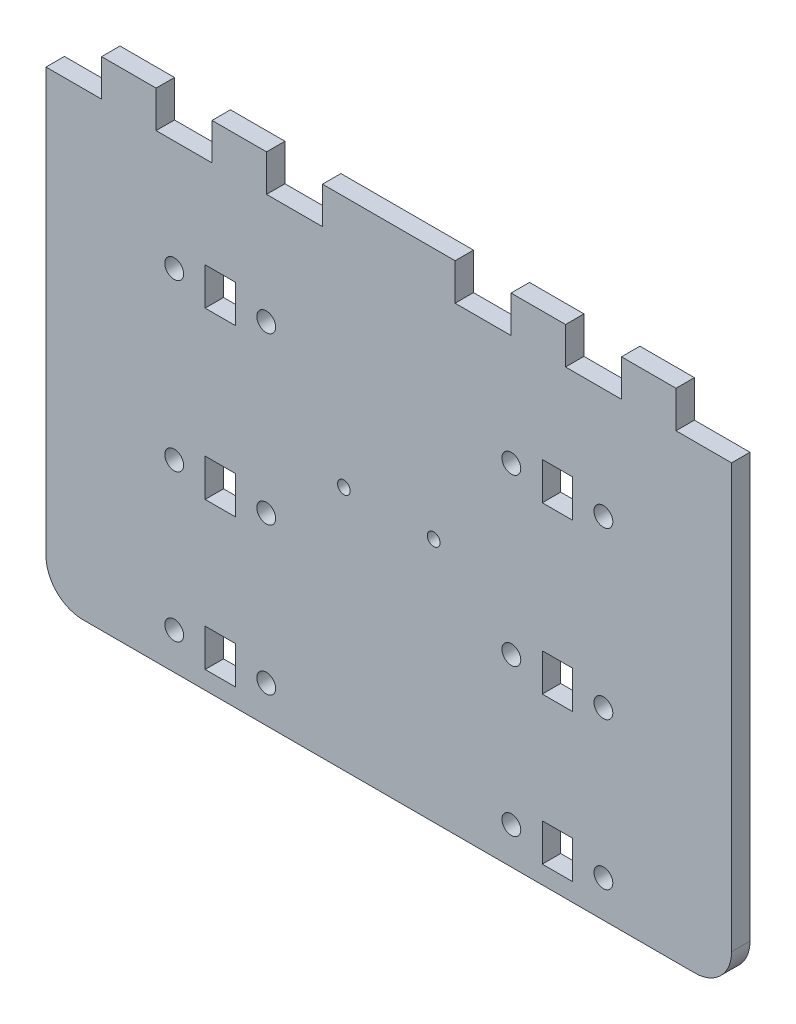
ISO-10303-21;
HEADER;
FILE_DESCRIPTION(('STEP AP214'),'2;1');
FILE_NAME('part.step','',(''),(''),'','','');
FILE_SCHEMA(('AUTOMOTIVE_DESIGN { 1 0 10303 214 1 1 1 1 }'));
ENDSEC;
DATA;
#1=APPLICATION_CONTEXT('core data for automotive mechanical design processes');
#2=APPLICATION_PROTOCOL_DEFINITION('international standard','automotive_design',2000,#1);
#3=PRODUCT_CONTEXT('',#1,'mechanical');
#4=PRODUCT('Part','Part','',(#3));
#5=PRODUCT_RELATED_PRODUCT_CATEGORY('part','',(#4));
#6=PRODUCT_DEFINITION_FORMATION('','',#4);
#7=PRODUCT_DEFINITION_CONTEXT('part definition',#1,'design');
#8=PRODUCT_DEFINITION('design','',#6,#7);
#9=PRODUCT_DEFINITION_SHAPE('','',#8);
#10=(LENGTH_UNIT() NAMED_UNIT(*) SI_UNIT(.MILLI.,.METRE.));
#11=(NAMED_UNIT(*) PLANE_ANGLE_UNIT() SI_UNIT($,.RADIAN.));
#12=(NAMED_UNIT(*) SI_UNIT($,.STERADIAN.) SOLID_ANGLE_UNIT());
#13=UNCERTAINTY_MEASURE_WITH_UNIT(LENGTH_MEASURE(1.E-05),#10,'distance_accuracy_value','');
#14=(GEOMETRIC_REPRESENTATION_CONTEXT(3) GLOBAL_UNCERTAINTY_ASSIGNED_CONTEXT((#13)) GLOBAL_UNIT_ASSIGNED_CONTEXT((#10,
#11,#12)) REPRESENTATION_CONTEXT('',''));
#15=CARTESIAN_POINT('',(0.,0.,0.));
#16=DIRECTION('',(0.,0.,1.));
#17=DIRECTION('',(1.,0.,0.));
#18=AXIS2_PLACEMENT_3D('',#15,#16,#17);
#19=CARTESIAN_POINT('',(0.,0.,-6.35));
#20=DIRECTION('',(0.,0.,1.));
#21=DIRECTION('',(1.,0.,0.));
#22=AXIS2_PLACEMENT_3D('',#19,#20,#21);
#23=PLANE('',#22);
#24=CARTESIAN_POINT('',(15.494,40.1320000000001,-6.35));
#25=DIRECTION('',(0.,0.,1.));
#26=DIRECTION('',(1.,0.,0.));
#27=AXIS2_PLACEMENT_3D('',#24,#25,#26);
#28=CIRCLE('',#27,2.2);
#29=CARTESIAN_POINT('',(17.694,40.1320000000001,-6.35));
#30=VERTEX_POINT('',#29);
#31=EDGE_CURVE('E1091',#30,#30,#28,.T.);
#32=ORIENTED_EDGE('',*,*,#31,.T.);
#33=EDGE_LOOP('',(#32));
#34=FACE_BOUND('',#33,.T.);
#35=CARTESIAN_POINT('',(-15.4940000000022,40.1320000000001,-6.35));
#36=DIRECTION('',(0.,0.,1.));
#37=DIRECTION('',(1.,0.,0.));
#38=AXIS2_PLACEMENT_3D('',#35,#36,#37);
#39=CIRCLE('',#38,2.2);
#40=CARTESIAN_POINT('',(-13.2940000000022,40.1320000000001,-6.35));
#41=VERTEX_POINT('',#40);
#42=EDGE_CURVE('E1099',#41,#41,#39,.T.);
#43=ORIENTED_EDGE('',*,*,#42,.T.);
#44=EDGE_LOOP('',(#43));
#45=FACE_BOUND('',#44,.T.);
#46=CARTESIAN_POINT('',(74.0259999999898,-31.749999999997,-6.35));
#47=DIRECTION('',(0.,0.,1.));
#48=DIRECTION('',(1.,0.,0.));
#49=AXIS2_PLACEMENT_3D('',#46,#47,#48);
#50=CIRCLE('',#49,3.25000000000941);
#51=CARTESIAN_POINT('',(77.2759999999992,-31.749999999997,-6.35));
#52=VERTEX_POINT('',#51);
#53=EDGE_CURVE('E383',#52,#52,#50,.F.);
#54=ORIENTED_EDGE('',*,*,#53,.F.);
#55=EDGE_LOOP('',(#54));
#56=FACE_BOUND('',#55,.T.);
#57=DIRECTION('',(0.,1.,0.));
#58=VECTOR('',#57,1.);
#59=CARTESIAN_POINT('',(-63.3580000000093,1.3575249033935E-13,-6.35));
#60=LINE('',#59,#58);
#61=CARTESIAN_POINT('',(-63.3580000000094,-38.2269999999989,-6.35));
#62=VERTEX_POINT('',#61);
#63=CARTESIAN_POINT('',(-63.3580000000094,-25.2730000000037,-6.35));
#64=VERTEX_POINT('',#63);
#65=EDGE_CURVE('E405',#62,#64,#60,.T.);
#66=ORIENTED_EDGE('',*,*,#65,.F.);
#67=DIRECTION('',(-1.,0.,0.));
#68=VECTOR('',#67,1.);
#69=CARTESIAN_POINT('',(0.,-38.2269999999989,-6.35));
#70=LINE('',#69,#68);
#71=CARTESIAN_POINT('',(-52.9440000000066,-38.2269999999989,-6.35));
#72=VERTEX_POINT('',#71);
#73=EDGE_CURVE('E407',#72,#62,#70,.T.);
#74=ORIENTED_EDGE('',*,*,#73,.F.);
#75=DIRECTION('',(0.,1.,0.));
#76=VECTOR('',#75,1.);
#77=CARTESIAN_POINT('',(-52.9440000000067,-1.13439184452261E-13,-6.35));
#78=LINE('',#77,#76);
#79=CARTESIAN_POINT('',(-52.9440000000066,-25.2730000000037,-6.35));
#80=VERTEX_POINT('',#79);
#81=EDGE_CURVE('E410',#72,#80,#78,.T.);
#82=ORIENTED_EDGE('',*,*,#81,.T.);
#83=DIRECTION('',(-1.,0.,0.));
#84=VECTOR('',#83,1.);
#85=CARTESIAN_POINT('',(0.,-25.2730000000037,-6.35));
#86=LINE('',#85,#84);
#87=EDGE_CURVE('E413',#80,#64,#86,.T.);
#88=ORIENTED_EDGE('',*,*,#87,.T.);
#89=EDGE_LOOP('',(#66,#74,#82,#88));
#90=FACE_BOUND('',#89,.T.);
#91=CARTESIAN_POINT('',(-74.02600000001,76.2000000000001,-6.35));
#92=DIRECTION('',(0.,0.,1.));
#93=DIRECTION('',(1.,0.,0.));
#94=AXIS2_PLACEMENT_3D('',#91,#92,#93);
#95=CIRCLE('',#94,3.24999999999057);
#96=CARTESIAN_POINT('',(-70.7760000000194,76.2000000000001,-6.35));
#97=VERTEX_POINT('',#96);
#98=EDGE_CURVE('E442',#97,#97,#95,.F.);
#99=ORIENTED_EDGE('',*,*,#98,.F.);
#100=EDGE_LOOP('',(#99));
#101=FACE_BOUND('',#100,.T.);
#102=CARTESIAN_POINT('',(-42.27600000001,76.2000000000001,-6.35));
#103=DIRECTION('',(0.,0.,1.));
#104=DIRECTION('',(1.,0.,0.));
#105=AXIS2_PLACEMENT_3D('',#102,#103,#104);
#106=CIRCLE('',#105,3.25000000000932);
#107=CARTESIAN_POINT('',(-39.0260000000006,76.2000000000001,-6.35));
#108=VERTEX_POINT('',#107);
#109=EDGE_CURVE('E454',#108,#108,#106,.F.);
#110=ORIENTED_EDGE('',*,*,#109,.F.);
#111=EDGE_LOOP('',(#110));
#112=FACE_BOUND('',#111,.T.);
#113=CARTESIAN_POINT('',(74.0259999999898,76.2000000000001,-6.35));
#114=DIRECTION('',(0.,0.,1.));
#115=DIRECTION('',(1.,0.,0.));
#116=AXIS2_PLACEMENT_3D('',#113,#114,#115);
#117=CIRCLE('',#116,3.25000000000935);
#118=CARTESIAN_POINT('',(77.2759999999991,76.2000000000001,-6.35));
#119=VERTEX_POINT('',#118);
#120=EDGE_CURVE('E460',#119,#119,#117,.T.);
#121=ORIENTED_EDGE('',*,*,#120,.T.);
#122=EDGE_LOOP('',(#121));
#123=FACE_BOUND('',#122,.T.);
#124=CARTESIAN_POINT('',(42.2759999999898,76.2000000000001,-6.35));
#125=DIRECTION('',(0.,0.,1.));
#126=DIRECTION('',(1.,0.,0.));
#127=AXIS2_PLACEMENT_3D('',#124,#125,#126);
#128=CIRCLE('',#127,3.25000000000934);
#129=CARTESIAN_POINT('',(45.5259999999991,76.2000000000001,-6.35));
#130=VERTEX_POINT('',#129);
#131=EDGE_CURVE('E466',#130,#130,#128,.T.);
#132=ORIENTED_EDGE('',*,*,#131,.T.);
#133=EDGE_LOOP('',(#132));
#134=FACE_BOUND('',#133,.T.);
#135=CARTESIAN_POINT('',(74.0259999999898,19.0500000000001,-6.35));
#136=DIRECTION('',(0.,0.,1.));
#137=DIRECTION('',(1.,0.,0.));
#138=AXIS2_PLACEMENT_3D('',#135,#136,#137);
#139=CIRCLE('',#138,3.25000000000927);
#140=CARTESIAN_POINT('',(77.2759999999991,19.0500000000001,-6.35));
#141=VERTEX_POINT('',#140);
#142=EDGE_CURVE('E472',#141,#141,#139,.T.);
#143=ORIENTED_EDGE('',*,*,#142,.T.);
#144=EDGE_LOOP('',(#143));
#145=FACE_BOUND('',#144,.T.);
#146=CARTESIAN_POINT('',(42.2759999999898,19.0500000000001,-6.35));
#147=DIRECTION('',(0.,0.,1.));
#148=DIRECTION('',(1.,0.,0.));
#149=AXIS2_PLACEMENT_3D('',#146,#147,#148);
#150=CIRCLE('',#149,3.25000000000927);
#151=CARTESIAN_POINT('',(45.525999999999,19.0500000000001,-6.35));
#152=VERTEX_POINT('',#151);
#153=EDGE_CURVE('E478',#152,#152,#150,.T.);
#154=ORIENTED_EDGE('',*,*,#153,.T.);
#155=EDGE_LOOP('',(#154));
#156=FACE_BOUND('',#155,.T.);
#157=DIRECTION('',(0.,1.,0.));
#158=VECTOR('',#157,1.);
#159=CARTESIAN_POINT('',(52.9439999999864,0.,-6.35));
#160=LINE('',#159,#158);
#161=CARTESIAN_POINT('',(52.9439999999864,69.7229999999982,-6.35));
#162=VERTEX_POINT('',#161);
#163=CARTESIAN_POINT('',(52.9439999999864,82.6769999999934,-6.35));
#164=VERTEX_POINT('',#163);
#165=EDGE_CURVE('E515',#162,#164,#160,.T.);
#166=ORIENTED_EDGE('',*,*,#165,.F.);
#167=DIRECTION('',(1.,0.,0.));
#168=VECTOR('',#167,1.);
#169=CARTESIAN_POINT('',(0.,69.7229999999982,-6.35));
#170=LINE('',#169,#168);
#171=CARTESIAN_POINT('',(63.3579999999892,69.7229999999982,-6.35));
#172=VERTEX_POINT('',#171);
#173=EDGE_CURVE('E517',#162,#172,#170,.T.);
#174=ORIENTED_EDGE('',*,*,#173,.T.);
#175=DIRECTION('',(0.,1.,0.));
#176=VECTOR('',#175,1.);
#177=CARTESIAN_POINT('',(63.3579999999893,0.,-6.35));
#178=LINE('',#177,#176);
#179=CARTESIAN_POINT('',(63.3579999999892,82.6769999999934,-6.35));
#180=VERTEX_POINT('',#179);
#181=EDGE_CURVE('E521',#172,#180,#178,.T.);
#182=ORIENTED_EDGE('',*,*,#181,.T.);
#183=DIRECTION('',(1.,0.,0.));
#184=VECTOR('',#183,1.);
#185=CARTESIAN_POINT('',(0.,82.6769999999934,-6.35));
#186=LINE('',#185,#184);
#187=EDGE_CURVE('E524',#164,#180,#186,.T.);
#188=ORIENTED_EDGE('',*,*,#187,.F.);
#189=EDGE_LOOP('',(#166,#174,#182,#188));
#190=FACE_BOUND('',#189,.T.);
#191=DIRECTION('',(0.,-1.,0.));
#192=VECTOR('',#191,1.);
#193=CARTESIAN_POINT('',(-52.9440000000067,0.,-6.35));
#194=LINE('',#193,#192);
#195=CARTESIAN_POINT('',(-52.9440000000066,25.5270000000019,-6.35));
#196=VERTEX_POINT('',#195);
#197=CARTESIAN_POINT('',(-52.9440000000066,12.5730000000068,-6.35));
#198=VERTEX_POINT('',#197);
#199=EDGE_CURVE('E578',#196,#198,#194,.T.);
#200=ORIENTED_EDGE('',*,*,#199,.F.);
#201=DIRECTION('',(-1.,0.,0.));
#202=VECTOR('',#201,1.);
#203=CARTESIAN_POINT('',(0.,25.5270000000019,-6.35));
#204=LINE('',#203,#202);
#205=CARTESIAN_POINT('',(-63.3580000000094,25.5270000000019,-6.35));
#206=VERTEX_POINT('',#205);
#207=EDGE_CURVE('E580',#196,#206,#204,.T.);
#208=ORIENTED_EDGE('',*,*,#207,.T.);
#209=DIRECTION('',(0.,-1.,0.));
#210=VECTOR('',#209,1.);
#211=CARTESIAN_POINT('',(-63.3580000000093,-2.03628735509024E-13,-6.35));
#212=LINE('',#211,#210);
#213=CARTESIAN_POINT('',(-63.3580000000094,12.5730000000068,-6.35));
#214=VERTEX_POINT('',#213);
#215=EDGE_CURVE('E584',#206,#214,#212,.T.);
#216=ORIENTED_EDGE('',*,*,#215,.T.);
#217=DIRECTION('',(-1.,0.,0.));
#218=VECTOR('',#217,1.);
#219=CARTESIAN_POINT('',(0.,12.5730000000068,-6.35));
#220=LINE('',#219,#218);
#221=EDGE_CURVE('E587',#198,#214,#220,.T.);
#222=ORIENTED_EDGE('',*,*,#221,.F.);
#223=EDGE_LOOP('',(#200,#208,#216,#222));
#224=FACE_BOUND('',#223,.T.);
#225=DIRECTION('',(0.,1.,0.));
#226=VECTOR('',#225,1.);
#227=CARTESIAN_POINT('',(118.25,114.3,-6.35));
#228=LINE('',#227,#226);
#229=CARTESIAN_POINT('',(118.25,-31.75,-6.35));
#230=VERTEX_POINT('',#229);
#231=CARTESIAN_POINT('',(118.25,114.3,-6.35));
#232=VERTEX_POINT('',#231);
#233=EDGE_CURVE('E619',#230,#232,#228,.T.);
#234=ORIENTED_EDGE('',*,*,#233,.F.);
#235=CARTESIAN_POINT('',(105.55,-31.75,-6.35));
#236=DIRECTION('',(0.,0.,1.));
#237=DIRECTION('',(1.,0.,0.));
#238=AXIS2_PLACEMENT_3D('',#235,#236,#237);
#239=CIRCLE('',#238,12.7);
#240=CARTESIAN_POINT('',(105.55,-44.45,-6.35));
#241=VERTEX_POINT('',#240);
#242=EDGE_CURVE('E43',#230,#241,#239,.F.);
#243=ORIENTED_EDGE('',*,*,#242,.T.);
#244=DIRECTION('',(1.,0.,0.));
#245=VECTOR('',#244,1.);
#246=CARTESIAN_POINT('',(-118.25,-44.45,-6.35));
#247=LINE('',#246,#245);
#248=CARTESIAN_POINT('',(-105.55,-44.45,-6.35));
#249=VERTEX_POINT('',#248);
#250=EDGE_CURVE('E610',#249,#241,#247,.T.);
#251=ORIENTED_EDGE('',*,*,#250,.F.);
#252=CARTESIAN_POINT('',(-105.55,-31.75,-6.35));
#253=DIRECTION('',(0.,0.,1.));
#254=DIRECTION('',(1.,0.,0.));
#255=AXIS2_PLACEMENT_3D('',#252,#253,#254);
#256=CIRCLE('',#255,12.7);
#257=CARTESIAN_POINT('',(-118.25,-31.75,-6.35));
#258=VERTEX_POINT('',#257);
#259=EDGE_CURVE('E807',#249,#258,#256,.F.);
#260=ORIENTED_EDGE('',*,*,#259,.T.);
#261=DIRECTION('',(0.,-1.,0.));
#262=VECTOR('',#261,1.);
#263=CARTESIAN_POINT('',(-118.25,114.3,-6.35));
#264=LINE('',#263,#262);
#265=CARTESIAN_POINT('',(-118.25,114.3,-6.35));
#266=VERTEX_POINT('',#265);
#267=EDGE_CURVE('E616',#266,#258,#264,.T.);
#268=ORIENTED_EDGE('',*,*,#267,.F.);
#269=DIRECTION('',(-1.,0.,0.));
#270=VECTOR('',#269,1.);
#271=CARTESIAN_POINT('',(-118.25,114.3,-6.35));
#272=LINE('',#271,#270);
#273=CARTESIAN_POINT('',(-99.073,114.3,-6.35));
#274=VERTEX_POINT('',#273);
#275=EDGE_CURVE('E682',#274,#266,#272,.T.);
#276=ORIENTED_EDGE('',*,*,#275,.F.);
#277=DIRECTION('',(0.,-1.,0.));
#278=VECTOR('',#277,1.);
#279=CARTESIAN_POINT('',(-99.073,114.3,-6.35));
#280=LINE('',#279,#278);
#281=CARTESIAN_POINT('',(-99.073,127.,-6.35));
#282=VERTEX_POINT('',#281);
#283=EDGE_CURVE('E679',#282,#274,#280,.T.);
#284=ORIENTED_EDGE('',*,*,#283,.F.);
#285=DIRECTION('',(-1.,0.,0.));
#286=VECTOR('',#285,1.);
#287=CARTESIAN_POINT('',(-99.073,127.,-6.35));
#288=LINE('',#287,#286);
#289=CARTESIAN_POINT('',(-80.277,127.,-6.35));
#290=VERTEX_POINT('',#289);
#291=EDGE_CURVE('E676',#290,#282,#288,.T.);
#292=ORIENTED_EDGE('',*,*,#291,.F.);
#293=DIRECTION('',(0.,1.,0.));
#294=VECTOR('',#293,1.);
#295=CARTESIAN_POINT('',(-80.277,127.,-6.35));
#296=LINE('',#295,#294);
#297=CARTESIAN_POINT('',(-80.277,114.3,-6.35));
#298=VERTEX_POINT('',#297);
#299=EDGE_CURVE('E673',#298,#290,#296,.T.);
#300=ORIENTED_EDGE('',*,*,#299,.F.);
#301=DIRECTION('',(-1.,0.,0.));
#302=VECTOR('',#301,1.);
#303=CARTESIAN_POINT('',(-80.277,114.3,-6.35));
#304=LINE('',#303,#302);
#305=CARTESIAN_POINT('',(-60.973,114.3,-6.35));
#306=VERTEX_POINT('',#305);
#307=EDGE_CURVE('E670',#306,#298,#304,.T.);
#308=ORIENTED_EDGE('',*,*,#307,.F.);
#309=DIRECTION('',(0.,-1.,0.));
#310=VECTOR('',#309,1.);
#311=CARTESIAN_POINT('',(-60.973,114.3,-6.35));
#312=LINE('',#311,#310);
#313=CARTESIAN_POINT('',(-60.973,127.,-6.35));
#314=VERTEX_POINT('',#313);
#315=EDGE_CURVE('E667',#314,#306,#312,.T.);
#316=ORIENTED_EDGE('',*,*,#315,.F.);
#317=DIRECTION('',(-1.,0.,0.));
#318=VECTOR('',#317,1.);
#319=CARTESIAN_POINT('',(-60.973,127.,-6.35));
#320=LINE('',#319,#318);
#321=CARTESIAN_POINT('',(-42.177,127.,-6.35));
#322=VERTEX_POINT('',#321);
#323=EDGE_CURVE('E664',#322,#314,#320,.T.);
#324=ORIENTED_EDGE('',*,*,#323,.F.);
#325=DIRECTION('',(0.,1.,0.));
#326=VECTOR('',#325,1.);
#327=CARTESIAN_POINT('',(-42.177,127.,-6.35));
#328=LINE('',#327,#326);
#329=CARTESIAN_POINT('',(-42.177,114.3,-6.35));
#330=VERTEX_POINT('',#329);
#331=EDGE_CURVE('E661',#330,#322,#328,.T.);
#332=ORIENTED_EDGE('',*,*,#331,.F.);
#333=DIRECTION('',(-1.,0.,0.));
#334=VECTOR('',#333,1.);
#335=CARTESIAN_POINT('',(-42.177,114.3,-6.35));
#336=LINE('',#335,#334);
#337=CARTESIAN_POINT('',(-22.873,114.3,-6.35));
#338=VERTEX_POINT('',#337);
#339=EDGE_CURVE('E658',#338,#330,#336,.T.);
#340=ORIENTED_EDGE('',*,*,#339,.F.);
#341=DIRECTION('',(0.,-1.,0.));
#342=VECTOR('',#341,1.);
#343=CARTESIAN_POINT('',(-22.873,114.3,-6.35));
#344=LINE('',#343,#342);
#345=CARTESIAN_POINT('',(-22.873,127.,-6.35));
#346=VERTEX_POINT('',#345);
#347=EDGE_CURVE('E655',#346,#338,#344,.T.);
#348=ORIENTED_EDGE('',*,*,#347,.F.);
#349=DIRECTION('',(-1.,0.,0.));
#350=VECTOR('',#349,1.);
#351=CARTESIAN_POINT('',(-22.873,127.,-6.35));
#352=LINE('',#351,#350);
#353=CARTESIAN_POINT('',(22.8729999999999,127.,-6.35));
#354=VERTEX_POINT('',#353);
#355=EDGE_CURVE('E652',#354,#346,#352,.T.);
#356=ORIENTED_EDGE('',*,*,#355,.F.);
#357=DIRECTION('',(0.,1.,0.));
#358=VECTOR('',#357,1.);
#359=CARTESIAN_POINT('',(22.8729999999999,114.3,-6.35));
#360=LINE('',#359,#358);
#361=CARTESIAN_POINT('',(22.8729999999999,114.3,-6.35));
#362=VERTEX_POINT('',#361);
#363=EDGE_CURVE('E649',#362,#354,#360,.T.);
#364=ORIENTED_EDGE('',*,*,#363,.F.);
#365=DIRECTION('',(-1.,0.,0.));
#366=VECTOR('',#365,1.);
#367=CARTESIAN_POINT('',(42.1769999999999,114.3,-6.35));
#368=LINE('',#367,#366);
#369=CARTESIAN_POINT('',(42.1769999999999,114.3,-6.35));
#370=VERTEX_POINT('',#369);
#371=EDGE_CURVE('E646',#370,#362,#368,.T.);
#372=ORIENTED_EDGE('',*,*,#371,.F.);
#373=DIRECTION('',(0.,-1.,0.));
#374=VECTOR('',#373,1.);
#375=CARTESIAN_POINT('',(42.1769999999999,127.,-6.35));
#376=LINE('',#375,#374);
#377=CARTESIAN_POINT('',(42.1769999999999,127.,-6.35));
#378=VERTEX_POINT('',#377);
#379=EDGE_CURVE('E643',#378,#370,#376,.T.);
#380=ORIENTED_EDGE('',*,*,#379,.F.);
#381=DIRECTION('',(-1.,0.,0.));
#382=VECTOR('',#381,1.);
#383=CARTESIAN_POINT('',(60.9729999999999,127.,-6.35));
#384=LINE('',#383,#382);
#385=CARTESIAN_POINT('',(60.9729999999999,127.,-6.35));
#386=VERTEX_POINT('',#385);
#387=EDGE_CURVE('E640',#386,#378,#384,.T.);
#388=ORIENTED_EDGE('',*,*,#387,.F.);
#389=DIRECTION('',(0.,1.,0.));
#390=VECTOR('',#389,1.);
#391=CARTESIAN_POINT('',(60.9729999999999,114.3,-6.35));
#392=LINE('',#391,#390);
#393=CARTESIAN_POINT('',(60.9729999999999,114.3,-6.35));
#394=VERTEX_POINT('',#393);
#395=EDGE_CURVE('E637',#394,#386,#392,.T.);
#396=ORIENTED_EDGE('',*,*,#395,.F.);
#397=DIRECTION('',(-1.,0.,0.));
#398=VECTOR('',#397,1.);
#399=CARTESIAN_POINT('',(80.2769999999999,114.3,-6.35));
#400=LINE('',#399,#398);
#401=CARTESIAN_POINT('',(80.2769999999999,114.3,-6.35));
#402=VERTEX_POINT('',#401);
#403=EDGE_CURVE('E634',#402,#394,#400,.T.);
#404=ORIENTED_EDGE('',*,*,#403,.F.);
#405=DIRECTION('',(0.,-1.,0.));
#406=VECTOR('',#405,1.);
#407=CARTESIAN_POINT('',(80.2769999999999,127.,-6.35));
#408=LINE('',#407,#406);
#409=CARTESIAN_POINT('',(80.2769999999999,127.,-6.35));
#410=VERTEX_POINT('',#409);
#411=EDGE_CURVE('E631',#410,#402,#408,.T.);
#412=ORIENTED_EDGE('',*,*,#411,.F.);
#413=DIRECTION('',(-1.,0.,0.));
#414=VECTOR('',#413,1.);
#415=CARTESIAN_POINT('',(99.0729999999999,127.,-6.35));
#416=LINE('',#415,#414);
#417=CARTESIAN_POINT('',(99.0729999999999,127.,-6.35));
#418=VERTEX_POINT('',#417);
#419=EDGE_CURVE('E628',#418,#410,#416,.T.);
#420=ORIENTED_EDGE('',*,*,#419,.F.);
#421=DIRECTION('',(0.,1.,0.));
#422=VECTOR('',#421,1.);
#423=CARTESIAN_POINT('',(99.0729999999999,114.3,-6.35));
#424=LINE('',#423,#422);
#425=CARTESIAN_POINT('',(99.0729999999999,114.3,-6.35));
#426=VERTEX_POINT('',#425);
#427=EDGE_CURVE('E625',#426,#418,#424,.T.);
#428=ORIENTED_EDGE('',*,*,#427,.F.);
#429=DIRECTION('',(-1.,0.,0.));
#430=VECTOR('',#429,1.);
#431=CARTESIAN_POINT('',(118.25,114.3,-6.35));
#432=LINE('',#431,#430);
#433=EDGE_CURVE('E622',#232,#426,#432,.T.);
#434=ORIENTED_EDGE('',*,*,#433,.F.);
#435=EDGE_LOOP('',(#234,#243,#251,#260,#268,#276,#284,#292,#300,#308,#316,#324,#332,#340,#348,
#356,#364,#372,#380,#388,#396,#404,#412,#420,#428,#434));
#436=FACE_BOUND('',#435,.T.);
#437=DIRECTION('',(0.,1.,0.));
#438=VECTOR('',#437,1.);
#439=CARTESIAN_POINT('',(-63.3580000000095,0.,-6.35));
#440=LINE('',#439,#438);
#441=CARTESIAN_POINT('',(-63.3580000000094,69.7229999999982,-6.35));
#442=VERTEX_POINT('',#441);
#443=CARTESIAN_POINT('',(-63.3580000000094,82.6769999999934,-6.35));
#444=VERTEX_POINT('',#443);
#445=EDGE_CURVE('E547',#442,#444,#440,.T.);
#446=ORIENTED_EDGE('',*,*,#445,.F.);
#447=DIRECTION('',(-1.,0.,0.));
#448=VECTOR('',#447,1.);
#449=CARTESIAN_POINT('',(0.,69.7229999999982,-6.35));
#450=LINE('',#449,#448);
#451=CARTESIAN_POINT('',(-52.9440000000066,69.7229999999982,-6.35));
#452=VERTEX_POINT('',#451);
#453=EDGE_CURVE('E549',#452,#442,#450,.T.);
#454=ORIENTED_EDGE('',*,*,#453,.F.);
#455=DIRECTION('',(0.,1.,0.));
#456=VECTOR('',#455,1.);
#457=CARTESIAN_POINT('',(-52.9440000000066,0.,-6.35));
#458=LINE('',#457,#456);
#459=CARTESIAN_POINT('',(-52.9440000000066,82.6769999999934,-6.35));
#460=VERTEX_POINT('',#459);
#461=EDGE_CURVE('E552',#452,#460,#458,.T.);
#462=ORIENTED_EDGE('',*,*,#461,.T.);
#463=DIRECTION('',(-1.,0.,0.));
#464=VECTOR('',#463,1.);
#465=CARTESIAN_POINT('',(-1.1017609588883E-13,82.6769999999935,-6.35));
#466=LINE('',#465,#464);
#467=EDGE_CURVE('E555',#460,#444,#466,.T.);
#468=ORIENTED_EDGE('',*,*,#467,.T.);
#469=EDGE_LOOP('',(#446,#454,#462,#468));
#470=FACE_BOUND('',#469,.T.);
#471=DIRECTION('',(0.,-1.,0.));
#472=VECTOR('',#471,1.);
#473=CARTESIAN_POINT('',(63.3579999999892,0.,-6.35));
#474=LINE('',#473,#472);
#475=CARTESIAN_POINT('',(63.3579999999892,25.5270000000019,-6.35));
#476=VERTEX_POINT('',#475);
#477=CARTESIAN_POINT('',(63.3579999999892,12.5730000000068,-6.35));
#478=VERTEX_POINT('',#477);
#479=EDGE_CURVE('E484',#476,#478,#474,.T.);
#480=ORIENTED_EDGE('',*,*,#479,.F.);
#481=DIRECTION('',(1.,0.,0.));
#482=VECTOR('',#481,1.);
#483=CARTESIAN_POINT('',(0.,25.5270000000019,-6.35));
#484=LINE('',#483,#482);
#485=CARTESIAN_POINT('',(52.9439999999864,25.5270000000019,-6.35));
#486=VERTEX_POINT('',#485);
#487=EDGE_CURVE('E486',#486,#476,#484,.T.);
#488=ORIENTED_EDGE('',*,*,#487,.F.);
#489=DIRECTION('',(0.,-1.,0.));
#490=VECTOR('',#489,1.);
#491=CARTESIAN_POINT('',(52.9439999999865,0.,-6.35));
#492=LINE('',#491,#490);
#493=CARTESIAN_POINT('',(52.9439999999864,12.5730000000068,-6.35));
#494=VERTEX_POINT('',#493);
#495=EDGE_CURVE('E489',#486,#494,#492,.T.);
#496=ORIENTED_EDGE('',*,*,#495,.T.);
#497=DIRECTION('',(1.,0.,0.));
#498=VECTOR('',#497,1.);
#499=CARTESIAN_POINT('',(0.,12.5730000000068,-6.35));
#500=LINE('',#499,#498);
#501=EDGE_CURVE('E492',#494,#478,#500,.T.);
#502=ORIENTED_EDGE('',*,*,#501,.T.);
#503=EDGE_LOOP('',(#480,#488,#496,#502));
#504=FACE_BOUND('',#503,.T.);
#505=CARTESIAN_POINT('',(-42.27600000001,19.0500000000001,-6.35));
#506=DIRECTION('',(0.,0.,1.));
#507=DIRECTION('',(1.,0.,0.));
#508=AXIS2_PLACEMENT_3D('',#505,#506,#507);
#509=CIRCLE('',#508,3.25000000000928);
#510=CARTESIAN_POINT('',(-39.0260000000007,19.0500000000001,-6.35));
#511=VERTEX_POINT('',#510);
#512=EDGE_CURVE('E448',#511,#511,#509,.F.);
#513=ORIENTED_EDGE('',*,*,#512,.F.);
#514=EDGE_LOOP('',(#513));
#515=FACE_BOUND('',#514,.T.);
#516=CARTESIAN_POINT('',(-74.02600000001,19.0500000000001,-6.35));
#517=DIRECTION('',(0.,0.,1.));
#518=DIRECTION('',(1.,0.,0.));
#519=AXIS2_PLACEMENT_3D('',#516,#517,#518);
#520=CIRCLE('',#519,3.24999999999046);
#521=CARTESIAN_POINT('',(-70.7760000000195,19.0500000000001,-6.35));
#522=VERTEX_POINT('',#521);
#523=EDGE_CURVE('E436',#522,#522,#520,.F.);
#524=ORIENTED_EDGE('',*,*,#523,.F.);
#525=EDGE_LOOP('',(#524));
#526=FACE_BOUND('',#525,.T.);
#527=CARTESIAN_POINT('',(-74.02600000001,-31.7499999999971,-6.35));
#528=DIRECTION('',(0.,0.,1.));
#529=DIRECTION('',(1.,0.,0.));
#530=AXIS2_PLACEMENT_3D('',#527,#528,#529);
#531=CIRCLE('',#530,3.24999999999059);
#532=CARTESIAN_POINT('',(-70.7760000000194,-31.7499999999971,-6.35));
#533=VERTEX_POINT('',#532);
#534=EDGE_CURVE('E399',#533,#533,#531,.T.);
#535=ORIENTED_EDGE('',*,*,#534,.T.);
#536=EDGE_LOOP('',(#535));
#537=FACE_BOUND('',#536,.T.);
#538=CARTESIAN_POINT('',(-42.27600000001,-31.7499999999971,-6.35));
#539=DIRECTION('',(0.,0.,1.));
#540=DIRECTION('',(1.,0.,0.));
#541=AXIS2_PLACEMENT_3D('',#538,#539,#540);
#542=CIRCLE('',#541,3.2500000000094);
#543=CARTESIAN_POINT('',(-39.0260000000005,-31.7499999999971,-6.35));
#544=VERTEX_POINT('',#543);
#545=EDGE_CURVE('E393',#544,#544,#542,.T.);
#546=ORIENTED_EDGE('',*,*,#545,.T.);
#547=EDGE_LOOP('',(#546));
#548=FACE_BOUND('',#547,.T.);
#549=DIRECTION('',(0.,1.,0.));
#550=VECTOR('',#549,1.);
#551=CARTESIAN_POINT('',(52.9439999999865,-1.13439184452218E-13,-6.35));
#552=LINE('',#551,#550);
#553=CARTESIAN_POINT('',(52.9439999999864,-38.2269999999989,-6.35));
#554=VERTEX_POINT('',#553);
#555=CARTESIAN_POINT('',(52.9439999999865,-25.2730000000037,-6.35));
#556=VERTEX_POINT('',#555);
#557=EDGE_CURVE('E355',#554,#556,#552,.T.);
#558=ORIENTED_EDGE('',*,*,#557,.F.);
#559=DIRECTION('',(1.,0.,0.));
#560=VECTOR('',#559,1.);
#561=CARTESIAN_POINT('',(0.,-38.2269999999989,-6.35));
#562=LINE('',#561,#560);
#563=CARTESIAN_POINT('',(63.3579999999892,-38.2269999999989,-6.35));
#564=VERTEX_POINT('',#563);
#565=EDGE_CURVE('E364',#554,#564,#562,.T.);
#566=ORIENTED_EDGE('',*,*,#565,.T.);
#567=DIRECTION('',(0.,1.,0.));
#568=VECTOR('',#567,1.);
#569=CARTESIAN_POINT('',(63.3579999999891,1.35752490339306E-13,-6.35));
#570=LINE('',#569,#568);
#571=CARTESIAN_POINT('',(63.3579999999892,-25.2730000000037,-6.35));
#572=VERTEX_POINT('',#571);
#573=EDGE_CURVE('E50',#564,#572,#570,.T.);
#574=ORIENTED_EDGE('',*,*,#573,.T.);
#575=DIRECTION('',(1.,0.,0.));
#576=VECTOR('',#575,1.);
#577=CARTESIAN_POINT('',(0.,-25.2730000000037,-6.35));
#578=LINE('',#577,#576);
#579=EDGE_CURVE('E361',#556,#572,#578,.T.);
#580=ORIENTED_EDGE('',*,*,#579,.F.);
#581=EDGE_LOOP('',(#558,#566,#574,#580));
#582=FACE_BOUND('',#581,.T.);
#583=CARTESIAN_POINT('',(42.2759999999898,-31.7499999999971,-6.35));
#584=DIRECTION('',(0.,0.,1.));
#585=DIRECTION('',(1.,0.,0.));
#586=AXIS2_PLACEMENT_3D('',#583,#584,#585);
#587=CIRCLE('',#586,3.2500000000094);
#588=CARTESIAN_POINT('',(45.5259999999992,-31.7499999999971,-6.35));
#589=VERTEX_POINT('',#588);
#590=EDGE_CURVE('E1105',#589,#589,#587,.F.);
#591=ORIENTED_EDGE('',*,*,#590,.F.);
#592=EDGE_LOOP('',(#591));
#593=FACE_BOUND('',#592,.T.);
#594=ADVANCED_FACE('F35',(#34,#45,#56,#90,#101,#112,#123,#134,#145,#156,#190,#224,#436,#470,
#504,#515,#526,#537,#548,#582,#593),#23,.F.);
#595=CARTESIAN_POINT('',(0.,0.,0.));
#596=DIRECTION('',(0.,0.,1.));
#597=DIRECTION('',(1.,0.,0.));
#598=AXIS2_PLACEMENT_3D('',#595,#596,#597);
#599=PLANE('',#598);
#600=CARTESIAN_POINT('',(15.494,40.1320000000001,0.));
#601=DIRECTION('',(0.,0.,1.));
#602=DIRECTION('',(1.,0.,0.));
#603=AXIS2_PLACEMENT_3D('',#600,#601,#602);
#604=CIRCLE('',#603,2.2);
#605=CARTESIAN_POINT('',(17.694,40.1320000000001,0.));
#606=VERTEX_POINT('',#605);
#607=EDGE_CURVE('E1094',#606,#606,#604,.T.);
#608=ORIENTED_EDGE('',*,*,#607,.F.);
#609=EDGE_LOOP('',(#608));
#610=FACE_BOUND('',#609,.T.);
#611=CARTESIAN_POINT('',(-15.4940000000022,40.1320000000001,0.));
#612=DIRECTION('',(0.,0.,1.));
#613=DIRECTION('',(1.,0.,0.));
#614=AXIS2_PLACEMENT_3D('',#611,#612,#613);
#615=CIRCLE('',#614,2.2);
#616=CARTESIAN_POINT('',(-13.2940000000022,40.1320000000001,0.));
#617=VERTEX_POINT('',#616);
#618=EDGE_CURVE('E1096',#617,#617,#615,.T.);
#619=ORIENTED_EDGE('',*,*,#618,.F.);
#620=EDGE_LOOP('',(#619));
#621=FACE_BOUND('',#620,.T.);
#622=CARTESIAN_POINT('',(74.0259999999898,-31.749999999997,0.));
#623=DIRECTION('',(0.,0.,1.));
#624=DIRECTION('',(1.,0.,0.));
#625=AXIS2_PLACEMENT_3D('',#622,#623,#624);
#626=CIRCLE('',#625,3.25000000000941);
#627=CARTESIAN_POINT('',(77.2759999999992,-31.749999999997,0.));
#628=VERTEX_POINT('',#627);
#629=EDGE_CURVE('E376',#628,#628,#626,.F.);
#630=ORIENTED_EDGE('',*,*,#629,.T.);
#631=EDGE_LOOP('',(#630));
#632=FACE_BOUND('',#631,.T.);
#633=DIRECTION('',(-1.,0.,0.));
#634=VECTOR('',#633,1.);
#635=CARTESIAN_POINT('',(0.,-38.2269999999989,0.));
#636=LINE('',#635,#634);
#637=CARTESIAN_POINT('',(-52.9440000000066,-38.2269999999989,0.));
#638=VERTEX_POINT('',#637);
#639=CARTESIAN_POINT('',(-63.3580000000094,-38.2269999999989,0.));
#640=VERTEX_POINT('',#639);
#641=EDGE_CURVE('E419',#638,#640,#636,.T.);
#642=ORIENTED_EDGE('',*,*,#641,.T.);
#643=DIRECTION('',(0.,1.,0.));
#644=VECTOR('',#643,1.);
#645=CARTESIAN_POINT('',(-63.3580000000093,1.3575249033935E-13,0.));
#646=LINE('',#645,#644);
#647=CARTESIAN_POINT('',(-63.3580000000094,-25.2730000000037,0.));
#648=VERTEX_POINT('',#647);
#649=EDGE_CURVE('E402',#640,#648,#646,.T.);
#650=ORIENTED_EDGE('',*,*,#649,.T.);
#651=DIRECTION('',(-1.,0.,0.));
#652=VECTOR('',#651,1.);
#653=CARTESIAN_POINT('',(0.,-25.2730000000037,0.));
#654=LINE('',#653,#652);
#655=CARTESIAN_POINT('',(-52.9440000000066,-25.2730000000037,0.));
#656=VERTEX_POINT('',#655);
#657=EDGE_CURVE('E408',#656,#648,#654,.T.);
#658=ORIENTED_EDGE('',*,*,#657,.F.);
#659=DIRECTION('',(0.,1.,0.));
#660=VECTOR('',#659,1.);
#661=CARTESIAN_POINT('',(-52.9440000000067,-1.13439184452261E-13,0.));
#662=LINE('',#661,#660);
#663=EDGE_CURVE('E422',#638,#656,#662,.T.);
#664=ORIENTED_EDGE('',*,*,#663,.F.);
#665=EDGE_LOOP('',(#642,#650,#658,#664));
#666=FACE_BOUND('',#665,.T.);
#667=CARTESIAN_POINT('',(-74.02600000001,76.2000000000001,0.));
#668=DIRECTION('',(0.,0.,1.));
#669=DIRECTION('',(1.,0.,0.));
#670=AXIS2_PLACEMENT_3D('',#667,#668,#669);
#671=CIRCLE('',#670,3.24999999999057);
#672=CARTESIAN_POINT('',(-70.7760000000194,76.2000000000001,0.));
#673=VERTEX_POINT('',#672);
#674=EDGE_CURVE('E439',#673,#673,#671,.F.);
#675=ORIENTED_EDGE('',*,*,#674,.T.);
#676=EDGE_LOOP('',(#675));
#677=FACE_BOUND('',#676,.T.);
#678=CARTESIAN_POINT('',(-42.27600000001,76.2000000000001,0.));
#679=DIRECTION('',(0.,0.,1.));
#680=DIRECTION('',(1.,0.,0.));
#681=AXIS2_PLACEMENT_3D('',#678,#679,#680);
#682=CIRCLE('',#681,3.25000000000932);
#683=CARTESIAN_POINT('',(-39.0260000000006,76.2000000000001,0.));
#684=VERTEX_POINT('',#683);
#685=EDGE_CURVE('E451',#684,#684,#682,.F.);
#686=ORIENTED_EDGE('',*,*,#685,.T.);
#687=EDGE_LOOP('',(#686));
#688=FACE_BOUND('',#687,.T.);
#689=CARTESIAN_POINT('',(74.0259999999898,76.2000000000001,0.));
#690=DIRECTION('',(0.,0.,1.));
#691=DIRECTION('',(1.,0.,0.));
#692=AXIS2_PLACEMENT_3D('',#689,#690,#691);
#693=CIRCLE('',#692,3.25000000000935);
#694=CARTESIAN_POINT('',(77.2759999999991,76.2000000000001,0.));
#695=VERTEX_POINT('',#694);
#696=EDGE_CURVE('E457',#695,#695,#693,.T.);
#697=ORIENTED_EDGE('',*,*,#696,.F.);
#698=EDGE_LOOP('',(#697));
#699=FACE_BOUND('',#698,.T.);
#700=CARTESIAN_POINT('',(42.2759999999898,76.2000000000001,0.));
#701=DIRECTION('',(0.,0.,1.));
#702=DIRECTION('',(1.,0.,0.));
#703=AXIS2_PLACEMENT_3D('',#700,#701,#702);
#704=CIRCLE('',#703,3.25000000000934);
#705=CARTESIAN_POINT('',(45.5259999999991,76.2000000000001,0.));
#706=VERTEX_POINT('',#705);
#707=EDGE_CURVE('E463',#706,#706,#704,.T.);
#708=ORIENTED_EDGE('',*,*,#707,.F.);
#709=EDGE_LOOP('',(#708));
#710=FACE_BOUND('',#709,.T.);
#711=CARTESIAN_POINT('',(74.0259999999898,19.0500000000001,0.));
#712=DIRECTION('',(0.,0.,1.));
#713=DIRECTION('',(1.,0.,0.));
#714=AXIS2_PLACEMENT_3D('',#711,#712,#713);
#715=CIRCLE('',#714,3.25000000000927);
#716=CARTESIAN_POINT('',(77.2759999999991,19.0500000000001,0.));
#717=VERTEX_POINT('',#716);
#718=EDGE_CURVE('E469',#717,#717,#715,.T.);
#719=ORIENTED_EDGE('',*,*,#718,.F.);
#720=EDGE_LOOP('',(#719));
#721=FACE_BOUND('',#720,.T.);
#722=CARTESIAN_POINT('',(42.2759999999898,19.0500000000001,0.));
#723=DIRECTION('',(0.,0.,1.));
#724=DIRECTION('',(1.,0.,0.));
#725=AXIS2_PLACEMENT_3D('',#722,#723,#724);
#726=CIRCLE('',#725,3.25000000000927);
#727=CARTESIAN_POINT('',(45.525999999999,19.0500000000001,0.));
#728=VERTEX_POINT('',#727);
#729=EDGE_CURVE('E475',#728,#728,#726,.T.);
#730=ORIENTED_EDGE('',*,*,#729,.F.);
#731=EDGE_LOOP('',(#730));
#732=FACE_BOUND('',#731,.T.);
#733=DIRECTION('',(1.,0.,0.));
#734=VECTOR('',#733,1.);
#735=CARTESIAN_POINT('',(0.,69.7229999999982,0.));
#736=LINE('',#735,#734);
#737=CARTESIAN_POINT('',(52.9439999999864,69.7229999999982,0.));
#738=VERTEX_POINT('',#737);
#739=CARTESIAN_POINT('',(63.3579999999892,69.7229999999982,0.));
#740=VERTEX_POINT('',#739);
#741=EDGE_CURVE('E529',#738,#740,#736,.T.);
#742=ORIENTED_EDGE('',*,*,#741,.F.);
#743=DIRECTION('',(0.,1.,0.));
#744=VECTOR('',#743,1.);
#745=CARTESIAN_POINT('',(52.9439999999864,0.,0.));
#746=LINE('',#745,#744);
#747=CARTESIAN_POINT('',(52.9439999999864,82.6769999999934,0.));
#748=VERTEX_POINT('',#747);
#749=EDGE_CURVE('E508',#738,#748,#746,.T.);
#750=ORIENTED_EDGE('',*,*,#749,.T.);
#751=DIRECTION('',(1.,0.,0.));
#752=VECTOR('',#751,1.);
#753=CARTESIAN_POINT('',(0.,82.6769999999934,0.));
#754=LINE('',#753,#752);
#755=CARTESIAN_POINT('',(63.3579999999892,82.6769999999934,0.));
#756=VERTEX_POINT('',#755);
#757=EDGE_CURVE('E518',#748,#756,#754,.T.);
#758=ORIENTED_EDGE('',*,*,#757,.T.);
#759=DIRECTION('',(0.,1.,0.));
#760=VECTOR('',#759,1.);
#761=CARTESIAN_POINT('',(63.3579999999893,0.,0.));
#762=LINE('',#761,#760);
#763=EDGE_CURVE('E532',#740,#756,#762,.T.);
#764=ORIENTED_EDGE('',*,*,#763,.F.);
#765=EDGE_LOOP('',(#742,#750,#758,#764));
#766=FACE_BOUND('',#765,.T.);
#767=DIRECTION('',(-1.,0.,0.));
#768=VECTOR('',#767,1.);
#769=CARTESIAN_POINT('',(0.,25.5270000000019,0.));
#770=LINE('',#769,#768);
#771=CARTESIAN_POINT('',(-52.9440000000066,25.5270000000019,0.));
#772=VERTEX_POINT('',#771);
#773=CARTESIAN_POINT('',(-63.3580000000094,25.5270000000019,0.));
#774=VERTEX_POINT('',#773);
#775=EDGE_CURVE('E592',#772,#774,#770,.T.);
#776=ORIENTED_EDGE('',*,*,#775,.F.);
#777=DIRECTION('',(0.,-1.,0.));
#778=VECTOR('',#777,1.);
#779=CARTESIAN_POINT('',(-52.9440000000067,0.,0.));
#780=LINE('',#779,#778);
#781=CARTESIAN_POINT('',(-52.9440000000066,12.5730000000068,0.));
#782=VERTEX_POINT('',#781);
#783=EDGE_CURVE('E571',#772,#782,#780,.T.);
#784=ORIENTED_EDGE('',*,*,#783,.T.);
#785=DIRECTION('',(-1.,0.,0.));
#786=VECTOR('',#785,1.);
#787=CARTESIAN_POINT('',(0.,12.5730000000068,0.));
#788=LINE('',#787,#786);
#789=CARTESIAN_POINT('',(-63.3580000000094,12.5730000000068,0.));
#790=VERTEX_POINT('',#789);
#791=EDGE_CURVE('E581',#782,#790,#788,.T.);
#792=ORIENTED_EDGE('',*,*,#791,.T.);
#793=DIRECTION('',(0.,-1.,0.));
#794=VECTOR('',#793,1.);
#795=CARTESIAN_POINT('',(-63.3580000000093,-2.03628735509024E-13,0.));
#796=LINE('',#795,#794);
#797=EDGE_CURVE('E595',#774,#790,#796,.T.);
#798=ORIENTED_EDGE('',*,*,#797,.F.);
#799=EDGE_LOOP('',(#776,#784,#792,#798));
#800=FACE_BOUND('',#799,.T.);
#801=DIRECTION('',(1.,0.,0.));
#802=VECTOR('',#801,1.);
#803=CARTESIAN_POINT('',(-118.25,-44.45,0.));
#804=LINE('',#803,#802);
#805=CARTESIAN_POINT('',(-105.55,-44.45,0.));
#806=VERTEX_POINT('',#805);
#807=CARTESIAN_POINT('',(105.55,-44.45,0.));
#808=VERTEX_POINT('',#807);
#809=EDGE_CURVE('E603',#806,#808,#804,.T.);
#810=ORIENTED_EDGE('',*,*,#809,.T.);
#811=CARTESIAN_POINT('',(105.55,-31.75,0.));
#812=DIRECTION('',(0.,0.,1.));
#813=DIRECTION('',(1.,0.,0.));
#814=AXIS2_PLACEMENT_3D('',#811,#812,#813);
#815=CIRCLE('',#814,12.7);
#816=CARTESIAN_POINT('',(118.25,-31.75,0.));
#817=VERTEX_POINT('',#816);
#818=EDGE_CURVE('E803',#808,#817,#815,.T.);
#819=ORIENTED_EDGE('',*,*,#818,.T.);
#820=DIRECTION('',(0.,1.,0.));
#821=VECTOR('',#820,1.);
#822=CARTESIAN_POINT('',(118.25,114.3,0.));
#823=LINE('',#822,#821);
#824=CARTESIAN_POINT('',(118.25,114.3,0.));
#825=VERTEX_POINT('',#824);
#826=EDGE_CURVE('E688',#817,#825,#823,.T.);
#827=ORIENTED_EDGE('',*,*,#826,.T.);
#828=DIRECTION('',(-1.,0.,0.));
#829=VECTOR('',#828,1.);
#830=CARTESIAN_POINT('',(118.25,114.3,0.));
#831=LINE('',#830,#829);
#832=CARTESIAN_POINT('',(99.0729999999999,114.3,0.));
#833=VERTEX_POINT('',#832);
#834=EDGE_CURVE('E690',#825,#833,#831,.T.);
#835=ORIENTED_EDGE('',*,*,#834,.T.);
#836=DIRECTION('',(0.,1.,0.));
#837=VECTOR('',#836,1.);
#838=CARTESIAN_POINT('',(99.0729999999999,114.3,0.));
#839=LINE('',#838,#837);
#840=CARTESIAN_POINT('',(99.0729999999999,127.,0.));
#841=VERTEX_POINT('',#840);
#842=EDGE_CURVE('E693',#833,#841,#839,.T.);
#843=ORIENTED_EDGE('',*,*,#842,.T.);
#844=DIRECTION('',(-1.,0.,0.));
#845=VECTOR('',#844,1.);
#846=CARTESIAN_POINT('',(99.0729999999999,127.,0.));
#847=LINE('',#846,#845);
#848=CARTESIAN_POINT('',(80.2769999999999,127.,0.));
#849=VERTEX_POINT('',#848);
#850=EDGE_CURVE('E696',#841,#849,#847,.T.);
#851=ORIENTED_EDGE('',*,*,#850,.T.);
#852=DIRECTION('',(0.,-1.,0.));
#853=VECTOR('',#852,1.);
#854=CARTESIAN_POINT('',(80.2769999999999,127.,0.));
#855=LINE('',#854,#853);
#856=CARTESIAN_POINT('',(80.2769999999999,114.3,0.));
#857=VERTEX_POINT('',#856);
#858=EDGE_CURVE('E699',#849,#857,#855,.T.);
#859=ORIENTED_EDGE('',*,*,#858,.T.);
#860=DIRECTION('',(-1.,0.,0.));
#861=VECTOR('',#860,1.);
#862=CARTESIAN_POINT('',(80.2769999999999,114.3,0.));
#863=LINE('',#862,#861);
#864=CARTESIAN_POINT('',(60.9729999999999,114.3,0.));
#865=VERTEX_POINT('',#864);
#866=EDGE_CURVE('E702',#857,#865,#863,.T.);
#867=ORIENTED_EDGE('',*,*,#866,.T.);
#868=DIRECTION('',(0.,1.,0.));
#869=VECTOR('',#868,1.);
#870=CARTESIAN_POINT('',(60.9729999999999,114.3,0.));
#871=LINE('',#870,#869);
#872=CARTESIAN_POINT('',(60.9729999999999,127.,0.));
#873=VERTEX_POINT('',#872);
#874=EDGE_CURVE('E705',#865,#873,#871,.T.);
#875=ORIENTED_EDGE('',*,*,#874,.T.);
#876=DIRECTION('',(-1.,0.,0.));
#877=VECTOR('',#876,1.);
#878=CARTESIAN_POINT('',(60.9729999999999,127.,0.));
#879=LINE('',#878,#877);
#880=CARTESIAN_POINT('',(42.1769999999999,127.,0.));
#881=VERTEX_POINT('',#880);
#882=EDGE_CURVE('E708',#873,#881,#879,.T.);
#883=ORIENTED_EDGE('',*,*,#882,.T.);
#884=DIRECTION('',(0.,-1.,0.));
#885=VECTOR('',#884,1.);
#886=CARTESIAN_POINT('',(42.1769999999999,127.,0.));
#887=LINE('',#886,#885);
#888=CARTESIAN_POINT('',(42.1769999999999,114.3,0.));
#889=VERTEX_POINT('',#888);
#890=EDGE_CURVE('E711',#881,#889,#887,.T.);
#891=ORIENTED_EDGE('',*,*,#890,.T.);
#892=DIRECTION('',(-1.,0.,0.));
#893=VECTOR('',#892,1.);
#894=CARTESIAN_POINT('',(42.1769999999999,114.3,0.));
#895=LINE('',#894,#893);
#896=CARTESIAN_POINT('',(22.8729999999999,114.3,0.));
#897=VERTEX_POINT('',#896);
#898=EDGE_CURVE('E714',#889,#897,#895,.T.);
#899=ORIENTED_EDGE('',*,*,#898,.T.);
#900=DIRECTION('',(0.,1.,0.));
#901=VECTOR('',#900,1.);
#902=CARTESIAN_POINT('',(22.8729999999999,114.3,0.));
#903=LINE('',#902,#901);
#904=CARTESIAN_POINT('',(22.8729999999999,127.,0.));
#905=VERTEX_POINT('',#904);
#906=EDGE_CURVE('E717',#897,#905,#903,.T.);
#907=ORIENTED_EDGE('',*,*,#906,.T.);
#908=DIRECTION('',(-1.,0.,0.));
#909=VECTOR('',#908,1.);
#910=CARTESIAN_POINT('',(-22.873,127.,0.));
#911=LINE('',#910,#909);
#912=CARTESIAN_POINT('',(-22.873,127.,0.));
#913=VERTEX_POINT('',#912);
#914=EDGE_CURVE('E720',#905,#913,#911,.T.);
#915=ORIENTED_EDGE('',*,*,#914,.T.);
#916=DIRECTION('',(0.,-1.,0.));
#917=VECTOR('',#916,1.);
#918=CARTESIAN_POINT('',(-22.873,114.3,0.));
#919=LINE('',#918,#917);
#920=CARTESIAN_POINT('',(-22.873,114.3,0.));
#921=VERTEX_POINT('',#920);
#922=EDGE_CURVE('E723',#913,#921,#919,.T.);
#923=ORIENTED_EDGE('',*,*,#922,.T.);
#924=DIRECTION('',(-1.,0.,0.));
#925=VECTOR('',#924,1.);
#926=CARTESIAN_POINT('',(-42.177,114.3,0.));
#927=LINE('',#926,#925);
#928=CARTESIAN_POINT('',(-42.177,114.3,0.));
#929=VERTEX_POINT('',#928);
#930=EDGE_CURVE('E726',#921,#929,#927,.T.);
#931=ORIENTED_EDGE('',*,*,#930,.T.);
#932=DIRECTION('',(0.,1.,0.));
#933=VECTOR('',#932,1.);
#934=CARTESIAN_POINT('',(-42.177,127.,0.));
#935=LINE('',#934,#933);
#936=CARTESIAN_POINT('',(-42.177,127.,0.));
#937=VERTEX_POINT('',#936);
#938=EDGE_CURVE('E729',#929,#937,#935,.T.);
#939=ORIENTED_EDGE('',*,*,#938,.T.);
#940=DIRECTION('',(-1.,0.,0.));
#941=VECTOR('',#940,1.);
#942=CARTESIAN_POINT('',(-60.973,127.,0.));
#943=LINE('',#942,#941);
#944=CARTESIAN_POINT('',(-60.973,127.,0.));
#945=VERTEX_POINT('',#944);
#946=EDGE_CURVE('E732',#937,#945,#943,.T.);
#947=ORIENTED_EDGE('',*,*,#946,.T.);
#948=DIRECTION('',(0.,-1.,0.));
#949=VECTOR('',#948,1.);
#950=CARTESIAN_POINT('',(-60.973,114.3,0.));
#951=LINE('',#950,#949);
#952=CARTESIAN_POINT('',(-60.973,114.3,0.));
#953=VERTEX_POINT('',#952);
#954=EDGE_CURVE('E735',#945,#953,#951,.T.);
#955=ORIENTED_EDGE('',*,*,#954,.T.);
#956=DIRECTION('',(-1.,0.,0.));
#957=VECTOR('',#956,1.);
#958=CARTESIAN_POINT('',(-80.277,114.3,0.));
#959=LINE('',#958,#957);
#960=CARTESIAN_POINT('',(-80.277,114.3,0.));
#961=VERTEX_POINT('',#960);
#962=EDGE_CURVE('E738',#953,#961,#959,.T.);
#963=ORIENTED_EDGE('',*,*,#962,.T.);
#964=DIRECTION('',(0.,1.,0.));
#965=VECTOR('',#964,1.);
#966=CARTESIAN_POINT('',(-80.277,127.,0.));
#967=LINE('',#966,#965);
#968=CARTESIAN_POINT('',(-80.277,127.,0.));
#969=VERTEX_POINT('',#968);
#970=EDGE_CURVE('E741',#961,#969,#967,.T.);
#971=ORIENTED_EDGE('',*,*,#970,.T.);
#972=DIRECTION('',(-1.,0.,0.));
#973=VECTOR('',#972,1.);
#974=CARTESIAN_POINT('',(-99.073,127.,0.));
#975=LINE('',#974,#973);
#976=CARTESIAN_POINT('',(-99.073,127.,0.));
#977=VERTEX_POINT('',#976);
#978=EDGE_CURVE('E744',#969,#977,#975,.T.);
#979=ORIENTED_EDGE('',*,*,#978,.T.);
#980=DIRECTION('',(0.,-1.,0.));
#981=VECTOR('',#980,1.);
#982=CARTESIAN_POINT('',(-99.073,114.3,0.));
#983=LINE('',#982,#981);
#984=CARTESIAN_POINT('',(-99.073,114.3,0.));
#985=VERTEX_POINT('',#984);
#986=EDGE_CURVE('E747',#977,#985,#983,.T.);
#987=ORIENTED_EDGE('',*,*,#986,.T.);
#988=DIRECTION('',(-1.,0.,0.));
#989=VECTOR('',#988,1.);
#990=CARTESIAN_POINT('',(-118.25,114.3,0.));
#991=LINE('',#990,#989);
#992=CARTESIAN_POINT('',(-118.25,114.3,0.));
#993=VERTEX_POINT('',#992);
#994=EDGE_CURVE('E620',#985,#993,#991,.T.);
#995=ORIENTED_EDGE('',*,*,#994,.T.);
#996=DIRECTION('',(0.,-1.,0.));
#997=VECTOR('',#996,1.);
#998=CARTESIAN_POINT('',(-118.25,114.3,0.));
#999=LINE('',#998,#997);
#1000=CARTESIAN_POINT('',(-118.25,-31.75,0.));
#1001=VERTEX_POINT('',#1000);
#1002=EDGE_CURVE('E613',#993,#1001,#999,.T.);
#1003=ORIENTED_EDGE('',*,*,#1002,.T.);
#1004=CARTESIAN_POINT('',(-105.55,-31.75,0.));
#1005=DIRECTION('',(0.,0.,1.));
#1006=DIRECTION('',(1.,0.,0.));
#1007=AXIS2_PLACEMENT_3D('',#1004,#1005,#1006);
#1008=CIRCLE('',#1007,12.7);
#1009=EDGE_CURVE('E801',#1001,#806,#1008,.T.);
#1010=ORIENTED_EDGE('',*,*,#1009,.T.);
#1011=EDGE_LOOP('',(#810,#819,#827,#835,#843,#851,#859,#867,#875,#883,#891,#899,#907,#915,#923,
#931,#939,#947,#955,#963,#971,#979,#987,#995,#1003,#1010));
#1012=FACE_BOUND('',#1011,.T.);
#1013=DIRECTION('',(-1.,0.,0.));
#1014=VECTOR('',#1013,1.);
#1015=CARTESIAN_POINT('',(0.,69.7229999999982,0.));
#1016=LINE('',#1015,#1014);
#1017=CARTESIAN_POINT('',(-52.9440000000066,69.7229999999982,0.));
#1018=VERTEX_POINT('',#1017);
#1019=CARTESIAN_POINT('',(-63.3580000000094,69.7229999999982,0.));
#1020=VERTEX_POINT('',#1019);
#1021=EDGE_CURVE('E561',#1018,#1020,#1016,.T.);
#1022=ORIENTED_EDGE('',*,*,#1021,.T.);
#1023=DIRECTION('',(0.,1.,0.));
#1024=VECTOR('',#1023,1.);
#1025=CARTESIAN_POINT('',(-63.3580000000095,0.,0.));
#1026=LINE('',#1025,#1024);
#1027=CARTESIAN_POINT('',(-63.3580000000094,82.6769999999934,0.));
#1028=VERTEX_POINT('',#1027);
#1029=EDGE_CURVE('E540',#1020,#1028,#1026,.T.);
#1030=ORIENTED_EDGE('',*,*,#1029,.T.);
#1031=DIRECTION('',(-1.,0.,0.));
#1032=VECTOR('',#1031,1.);
#1033=CARTESIAN_POINT('',(-1.1017609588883E-13,82.6769999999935,0.));
#1034=LINE('',#1033,#1032);
#1035=CARTESIAN_POINT('',(-52.9440000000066,82.6769999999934,0.));
#1036=VERTEX_POINT('',#1035);
#1037=EDGE_CURVE('E550',#1036,#1028,#1034,.T.);
#1038=ORIENTED_EDGE('',*,*,#1037,.F.);
#1039=DIRECTION('',(0.,1.,0.));
#1040=VECTOR('',#1039,1.);
#1041=CARTESIAN_POINT('',(-52.9440000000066,0.,0.));
#1042=LINE('',#1041,#1040);
#1043=EDGE_CURVE('E564',#1018,#1036,#1042,.T.);
#1044=ORIENTED_EDGE('',*,*,#1043,.F.);
#1045=EDGE_LOOP('',(#1022,#1030,#1038,#1044));
#1046=FACE_BOUND('',#1045,.T.);
#1047=DIRECTION('',(1.,0.,0.));
#1048=VECTOR('',#1047,1.);
#1049=CARTESIAN_POINT('',(0.,25.5270000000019,0.));
#1050=LINE('',#1049,#1048);
#1051=CARTESIAN_POINT('',(52.9439999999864,25.5270000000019,0.));
#1052=VERTEX_POINT('',#1051);
#1053=CARTESIAN_POINT('',(63.3579999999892,25.5270000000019,0.));
#1054=VERTEX_POINT('',#1053);
#1055=EDGE_CURVE('E498',#1052,#1054,#1050,.T.);
#1056=ORIENTED_EDGE('',*,*,#1055,.T.);
#1057=DIRECTION('',(0.,-1.,0.));
#1058=VECTOR('',#1057,1.);
#1059=CARTESIAN_POINT('',(63.3579999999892,0.,0.));
#1060=LINE('',#1059,#1058);
#1061=CARTESIAN_POINT('',(63.3579999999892,12.5730000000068,0.));
#1062=VERTEX_POINT('',#1061);
#1063=EDGE_CURVE('E481',#1054,#1062,#1060,.T.);
#1064=ORIENTED_EDGE('',*,*,#1063,.T.);
#1065=DIRECTION('',(1.,0.,0.));
#1066=VECTOR('',#1065,1.);
#1067=CARTESIAN_POINT('',(0.,12.5730000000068,0.));
#1068=LINE('',#1067,#1066);
#1069=CARTESIAN_POINT('',(52.9439999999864,12.5730000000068,0.));
#1070=VERTEX_POINT('',#1069);
#1071=EDGE_CURVE('E487',#1070,#1062,#1068,.T.);
#1072=ORIENTED_EDGE('',*,*,#1071,.F.);
#1073=DIRECTION('',(0.,-1.,0.));
#1074=VECTOR('',#1073,1.);
#1075=CARTESIAN_POINT('',(52.9439999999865,0.,0.));
#1076=LINE('',#1075,#1074);
#1077=EDGE_CURVE('E501',#1052,#1070,#1076,.T.);
#1078=ORIENTED_EDGE('',*,*,#1077,.F.);
#1079=EDGE_LOOP('',(#1056,#1064,#1072,#1078));
#1080=FACE_BOUND('',#1079,.T.);
#1081=CARTESIAN_POINT('',(-42.27600000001,19.0500000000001,0.));
#1082=DIRECTION('',(0.,0.,1.));
#1083=DIRECTION('',(1.,0.,0.));
#1084=AXIS2_PLACEMENT_3D('',#1081,#1082,#1083);
#1085=CIRCLE('',#1084,3.25000000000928);
#1086=CARTESIAN_POINT('',(-39.0260000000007,19.0500000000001,0.));
#1087=VERTEX_POINT('',#1086);
#1088=EDGE_CURVE('E445',#1087,#1087,#1085,.F.);
#1089=ORIENTED_EDGE('',*,*,#1088,.T.);
#1090=EDGE_LOOP('',(#1089));
#1091=FACE_BOUND('',#1090,.T.);
#1092=CARTESIAN_POINT('',(-74.02600000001,19.0500000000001,0.));
#1093=DIRECTION('',(0.,0.,1.));
#1094=DIRECTION('',(1.,0.,0.));
#1095=AXIS2_PLACEMENT_3D('',#1092,#1093,#1094);
#1096=CIRCLE('',#1095,3.24999999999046);
#1097=CARTESIAN_POINT('',(-70.7760000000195,19.0500000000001,0.));
#1098=VERTEX_POINT('',#1097);
#1099=EDGE_CURVE('E429',#1098,#1098,#1096,.F.);
#1100=ORIENTED_EDGE('',*,*,#1099,.T.);
#1101=EDGE_LOOP('',(#1100));
#1102=FACE_BOUND('',#1101,.T.);
#1103=CARTESIAN_POINT('',(-74.02600000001,-31.7499999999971,0.));
#1104=DIRECTION('',(0.,0.,1.));
#1105=DIRECTION('',(1.,0.,0.));
#1106=AXIS2_PLACEMENT_3D('',#1103,#1104,#1105);
#1107=CIRCLE('',#1106,3.24999999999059);
#1108=CARTESIAN_POINT('',(-70.7760000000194,-31.7499999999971,0.));
#1109=VERTEX_POINT('',#1108);
#1110=EDGE_CURVE('E396',#1109,#1109,#1107,.T.);
#1111=ORIENTED_EDGE('',*,*,#1110,.F.);
#1112=EDGE_LOOP('',(#1111));
#1113=FACE_BOUND('',#1112,.T.);
#1114=CARTESIAN_POINT('',(-42.27600000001,-31.7499999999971,0.));
#1115=DIRECTION('',(0.,0.,1.));
#1116=DIRECTION('',(1.,0.,0.));
#1117=AXIS2_PLACEMENT_3D('',#1114,#1115,#1116);
#1118=CIRCLE('',#1117,3.2500000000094);
#1119=CARTESIAN_POINT('',(-39.0260000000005,-31.7499999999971,0.));
#1120=VERTEX_POINT('',#1119);
#1121=EDGE_CURVE('E389',#1120,#1120,#1118,.T.);
#1122=ORIENTED_EDGE('',*,*,#1121,.F.);
#1123=EDGE_LOOP('',(#1122));
#1124=FACE_BOUND('',#1123,.T.);
#1125=DIRECTION('',(1.,0.,0.));
#1126=VECTOR('',#1125,1.);
#1127=CARTESIAN_POINT('',(0.,-38.2269999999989,0.));
#1128=LINE('',#1127,#1126);
#1129=CARTESIAN_POINT('',(52.9439999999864,-38.2269999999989,0.));
#1130=VERTEX_POINT('',#1129);
#1131=CARTESIAN_POINT('',(63.3579999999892,-38.2269999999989,0.));
#1132=VERTEX_POINT('',#1131);
#1133=EDGE_CURVE('E382',#1130,#1132,#1128,.T.);
#1134=ORIENTED_EDGE('',*,*,#1133,.F.);
#1135=DIRECTION('',(0.,1.,0.));
#1136=VECTOR('',#1135,1.);
#1137=CARTESIAN_POINT('',(52.9439999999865,-1.13439184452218E-13,0.));
#1138=LINE('',#1137,#1136);
#1139=CARTESIAN_POINT('',(52.9439999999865,-25.2730000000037,0.));
#1140=VERTEX_POINT('',#1139);
#1141=EDGE_CURVE('E58',#1130,#1140,#1138,.T.);
#1142=ORIENTED_EDGE('',*,*,#1141,.T.);
#1143=DIRECTION('',(1.,0.,0.));
#1144=VECTOR('',#1143,1.);
#1145=CARTESIAN_POINT('',(0.,-25.2730000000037,0.));
#1146=LINE('',#1145,#1144);
#1147=CARTESIAN_POINT('',(63.3579999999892,-25.2730000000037,0.));
#1148=VERTEX_POINT('',#1147);
#1149=EDGE_CURVE('E370',#1140,#1148,#1146,.T.);
#1150=ORIENTED_EDGE('',*,*,#1149,.T.);
#1151=DIRECTION('',(0.,1.,0.));
#1152=VECTOR('',#1151,1.);
#1153=CARTESIAN_POINT('',(63.3579999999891,1.35752490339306E-13,0.));
#1154=LINE('',#1153,#1152);
#1155=EDGE_CURVE('E373',#1132,#1148,#1154,.T.);
#1156=ORIENTED_EDGE('',*,*,#1155,.F.);
#1157=EDGE_LOOP('',(#1134,#1142,#1150,#1156));
#1158=FACE_BOUND('',#1157,.T.);
#1159=CARTESIAN_POINT('',(42.2759999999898,-31.7499999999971,0.));
#1160=DIRECTION('',(0.,0.,1.));
#1161=DIRECTION('',(1.,0.,0.));
#1162=AXIS2_PLACEMENT_3D('',#1159,#1160,#1161);
#1163=CIRCLE('',#1162,3.2500000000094);
#1164=CARTESIAN_POINT('',(45.5259999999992,-31.7499999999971,0.));
#1165=VERTEX_POINT('',#1164);
#1166=EDGE_CURVE('E1102',#1165,#1165,#1163,.F.);
#1167=ORIENTED_EDGE('',*,*,#1166,.T.);
#1168=EDGE_LOOP('',(#1167));
#1169=FACE_BOUND('',#1168,.T.);
#1170=ADVANCED_FACE('F825',(#610,#621,#632,#666,#677,#688,#699,#710,#721,#732,#766,#800,#1012,
#1046,#1080,#1091,#1102,#1113,#1124,#1158,#1169),#599,.T.);
#1171=CARTESIAN_POINT('',(-118.25,114.3,-6.35));
#1172=DIRECTION('',(-1.,0.,0.));
#1173=DIRECTION('',(0.,-1.,0.));
#1174=AXIS2_PLACEMENT_3D('',#1171,#1172,#1173);
#1175=PLANE('',#1174);
#1176=ORIENTED_EDGE('',*,*,#267,.T.);
#1177=DIRECTION('',(0.,0.,1.));
#1178=VECTOR('',#1177,1.);
#1179=CARTESIAN_POINT('',(-118.25,-31.75,-6.35));
#1180=LINE('',#1179,#1178);
#1181=EDGE_CURVE('E11',#258,#1001,#1180,.T.);
#1182=ORIENTED_EDGE('',*,*,#1181,.T.);
#1183=ORIENTED_EDGE('',*,*,#1002,.F.);
#1184=DIRECTION('',(0.,0.,1.));
#1185=VECTOR('',#1184,1.);
#1186=CARTESIAN_POINT('',(-118.25,114.3,-6.35));
#1187=LINE('',#1186,#1185);
#1188=EDGE_CURVE('E752',#266,#993,#1187,.T.);
#1189=ORIENTED_EDGE('',*,*,#1188,.F.);
#1190=EDGE_LOOP('',(#1176,#1182,#1183,#1189));
#1191=FACE_BOUND('',#1190,.T.);
#1192=ADVANCED_FACE('F914',(#1191),#1175,.T.);
#1193=CARTESIAN_POINT('',(-118.25,114.3,-6.35));
#1194=DIRECTION('',(0.,1.,0.));
#1195=DIRECTION('',(-1.,0.,0.));
#1196=AXIS2_PLACEMENT_3D('',#1193,#1194,#1195);
#1197=PLANE('',#1196);
#1198=ORIENTED_EDGE('',*,*,#994,.F.);
#1199=DIRECTION('',(0.,0.,1.));
#1200=VECTOR('',#1199,1.);
#1201=CARTESIAN_POINT('',(-99.073,114.3,-6.35));
#1202=LINE('',#1201,#1200);
#1203=EDGE_CURVE('E755',#274,#985,#1202,.T.);
#1204=ORIENTED_EDGE('',*,*,#1203,.F.);
#1205=ORIENTED_EDGE('',*,*,#275,.T.);
#1206=ORIENTED_EDGE('',*,*,#1188,.T.);
#1207=EDGE_LOOP('',(#1198,#1204,#1205,#1206));
#1208=FACE_BOUND('',#1207,.T.);
#1209=ADVANCED_FACE('F909',(#1208),#1197,.T.);
#1210=CARTESIAN_POINT('',(-99.073,114.3,-6.35));
#1211=DIRECTION('',(-1.,0.,0.));
#1212=DIRECTION('',(0.,0.,1.));
#1213=AXIS2_PLACEMENT_3D('',#1210,#1211,#1212);
#1214=PLANE('',#1213);
#1215=ORIENTED_EDGE('',*,*,#986,.F.);
#1216=DIRECTION('',(0.,0.,1.));
#1217=VECTOR('',#1216,1.);
#1218=CARTESIAN_POINT('',(-99.073,127.,-6.35));
#1219=LINE('',#1218,#1217);
#1220=EDGE_CURVE('E757',#282,#977,#1219,.T.);
#1221=ORIENTED_EDGE('',*,*,#1220,.F.);
#1222=ORIENTED_EDGE('',*,*,#283,.T.);
#1223=ORIENTED_EDGE('',*,*,#1203,.T.);
#1224=EDGE_LOOP('',(#1215,#1221,#1222,#1223));
#1225=FACE_BOUND('',#1224,.T.);
#1226=ADVANCED_FACE('F918',(#1225),#1214,.T.);
#1227=CARTESIAN_POINT('',(-99.073,127.,-6.35));
#1228=DIRECTION('',(0.,1.,0.));
#1229=DIRECTION('',(0.,0.,1.));
#1230=AXIS2_PLACEMENT_3D('',#1227,#1228,#1229);
#1231=PLANE('',#1230);
#1232=ORIENTED_EDGE('',*,*,#978,.F.);
#1233=DIRECTION('',(0.,0.,1.));
#1234=VECTOR('',#1233,1.);
#1235=CARTESIAN_POINT('',(-80.277,127.,-6.35));
#1236=LINE('',#1235,#1234);
#1237=EDGE_CURVE('E759',#290,#969,#1236,.T.);
#1238=ORIENTED_EDGE('',*,*,#1237,.F.);
#1239=ORIENTED_EDGE('',*,*,#291,.T.);
#1240=ORIENTED_EDGE('',*,*,#1220,.T.);
#1241=EDGE_LOOP('',(#1232,#1238,#1239,#1240));
#1242=FACE_BOUND('',#1241,.T.);
#1243=ADVANCED_FACE('F904',(#1242),#1231,.T.);
#1244=CARTESIAN_POINT('',(-80.277,127.,-6.35));
#1245=DIRECTION('',(1.,0.,0.));
#1246=DIRECTION('',(0.,1.,0.));
#1247=AXIS2_PLACEMENT_3D('',#1244,#1245,#1246);
#1248=PLANE('',#1247);
#1249=ORIENTED_EDGE('',*,*,#970,.F.);
#1250=DIRECTION('',(0.,0.,1.));
#1251=VECTOR('',#1250,1.);
#1252=CARTESIAN_POINT('',(-80.277,114.3,-6.35));
#1253=LINE('',#1252,#1251);
#1254=EDGE_CURVE('E761',#298,#961,#1253,.T.);
#1255=ORIENTED_EDGE('',*,*,#1254,.F.);
#1256=ORIENTED_EDGE('',*,*,#299,.T.);
#1257=ORIENTED_EDGE('',*,*,#1237,.T.);
#1258=EDGE_LOOP('',(#1249,#1255,#1256,#1257));
#1259=FACE_BOUND('',#1258,.T.);
#1260=ADVANCED_FACE('F900',(#1259),#1248,.T.);
#1261=CARTESIAN_POINT('',(-80.277,114.3,-6.35));
#1262=DIRECTION('',(0.,1.,0.));
#1263=DIRECTION('',(-1.,0.,0.));
#1264=AXIS2_PLACEMENT_3D('',#1261,#1262,#1263);
#1265=PLANE('',#1264);
#1266=ORIENTED_EDGE('',*,*,#962,.F.);
#1267=DIRECTION('',(0.,0.,1.));
#1268=VECTOR('',#1267,1.);
#1269=CARTESIAN_POINT('',(-60.973,114.3,-6.35));
#1270=LINE('',#1269,#1268);
#1271=EDGE_CURVE('E763',#306,#953,#1270,.T.);
#1272=ORIENTED_EDGE('',*,*,#1271,.F.);
#1273=ORIENTED_EDGE('',*,*,#307,.T.);
#1274=ORIENTED_EDGE('',*,*,#1254,.T.);
#1275=EDGE_LOOP('',(#1266,#1272,#1273,#1274));
#1276=FACE_BOUND('',#1275,.T.);
#1277=ADVANCED_FACE('F896',(#1276),#1265,.T.);
#1278=CARTESIAN_POINT('',(-60.973,114.3,-6.35));
#1279=DIRECTION('',(-1.,0.,0.));
#1280=DIRECTION('',(0.,0.,1.));
#1281=AXIS2_PLACEMENT_3D('',#1278,#1279,#1280);
#1282=PLANE('',#1281);
#1283=ORIENTED_EDGE('',*,*,#954,.F.);
#1284=DIRECTION('',(0.,0.,1.));
#1285=VECTOR('',#1284,1.);
#1286=CARTESIAN_POINT('',(-60.973,127.,-6.35));
#1287=LINE('',#1286,#1285);
#1288=EDGE_CURVE('E765',#314,#945,#1287,.T.);
#1289=ORIENTED_EDGE('',*,*,#1288,.F.);
#1290=ORIENTED_EDGE('',*,*,#315,.T.);
#1291=ORIENTED_EDGE('',*,*,#1271,.T.);
#1292=EDGE_LOOP('',(#1283,#1289,#1290,#1291));
#1293=FACE_BOUND('',#1292,.T.);
#1294=ADVANCED_FACE('F892',(#1293),#1282,.T.);
#1295=CARTESIAN_POINT('',(-60.973,127.,-6.35));
#1296=DIRECTION('',(0.,1.,0.));
#1297=DIRECTION('',(0.,0.,1.));
#1298=AXIS2_PLACEMENT_3D('',#1295,#1296,#1297);
#1299=PLANE('',#1298);
#1300=ORIENTED_EDGE('',*,*,#946,.F.);
#1301=DIRECTION('',(0.,0.,1.));
#1302=VECTOR('',#1301,1.);
#1303=CARTESIAN_POINT('',(-42.177,127.,-6.35));
#1304=LINE('',#1303,#1302);
#1305=EDGE_CURVE('E767',#322,#937,#1304,.T.);
#1306=ORIENTED_EDGE('',*,*,#1305,.F.);
#1307=ORIENTED_EDGE('',*,*,#323,.T.);
#1308=ORIENTED_EDGE('',*,*,#1288,.T.);
#1309=EDGE_LOOP('',(#1300,#1306,#1307,#1308));
#1310=FACE_BOUND('',#1309,.T.);
#1311=ADVANCED_FACE('F888',(#1310),#1299,.T.);
#1312=CARTESIAN_POINT('',(-42.177,127.,-6.35));
#1313=DIRECTION('',(1.,0.,0.));
#1314=DIRECTION('',(0.,1.,0.));
#1315=AXIS2_PLACEMENT_3D('',#1312,#1313,#1314);
#1316=PLANE('',#1315);
#1317=ORIENTED_EDGE('',*,*,#938,.F.);
#1318=DIRECTION('',(0.,0.,1.));
#1319=VECTOR('',#1318,1.);
#1320=CARTESIAN_POINT('',(-42.177,114.3,-6.35));
#1321=LINE('',#1320,#1319);
#1322=EDGE_CURVE('E769',#330,#929,#1321,.T.);
#1323=ORIENTED_EDGE('',*,*,#1322,.F.);
#1324=ORIENTED_EDGE('',*,*,#331,.T.);
#1325=ORIENTED_EDGE('',*,*,#1305,.T.);
#1326=EDGE_LOOP('',(#1317,#1323,#1324,#1325));
#1327=FACE_BOUND('',#1326,.T.);
#1328=ADVANCED_FACE('F884',(#1327),#1316,.T.);
#1329=CARTESIAN_POINT('',(-42.177,114.3,-6.35));
#1330=DIRECTION('',(0.,1.,0.));
#1331=DIRECTION('',(0.,0.,1.));
#1332=AXIS2_PLACEMENT_3D('',#1329,#1330,#1331);
#1333=PLANE('',#1332);
#1334=ORIENTED_EDGE('',*,*,#930,.F.);
#1335=DIRECTION('',(0.,0.,1.));
#1336=VECTOR('',#1335,1.);
#1337=CARTESIAN_POINT('',(-22.873,114.3,-6.35));
#1338=LINE('',#1337,#1336);
#1339=EDGE_CURVE('E771',#338,#921,#1338,.T.);
#1340=ORIENTED_EDGE('',*,*,#1339,.F.);
#1341=ORIENTED_EDGE('',*,*,#339,.T.);
#1342=ORIENTED_EDGE('',*,*,#1322,.T.);
#1343=EDGE_LOOP('',(#1334,#1340,#1341,#1342));
#1344=FACE_BOUND('',#1343,.T.);
#1345=ADVANCED_FACE('F880',(#1344),#1333,.T.);
#1346=CARTESIAN_POINT('',(-22.873,114.3,-6.35));
#1347=DIRECTION('',(-1.,0.,0.));
#1348=DIRECTION('',(0.,-1.,0.));
#1349=AXIS2_PLACEMENT_3D('',#1346,#1347,#1348);
#1350=PLANE('',#1349);
#1351=ORIENTED_EDGE('',*,*,#922,.F.);
#1352=DIRECTION('',(0.,0.,1.));
#1353=VECTOR('',#1352,1.);
#1354=CARTESIAN_POINT('',(-22.873,127.,-6.35));
#1355=LINE('',#1354,#1353);
#1356=EDGE_CURVE('E773',#346,#913,#1355,.T.);
#1357=ORIENTED_EDGE('',*,*,#1356,.F.);
#1358=ORIENTED_EDGE('',*,*,#347,.T.);
#1359=ORIENTED_EDGE('',*,*,#1339,.T.);
#1360=EDGE_LOOP('',(#1351,#1357,#1358,#1359));
#1361=FACE_BOUND('',#1360,.T.);
#1362=ADVANCED_FACE('F876',(#1361),#1350,.T.);
#1363=CARTESIAN_POINT('',(-22.873,127.,-6.35));
#1364=DIRECTION('',(0.,1.,0.));
#1365=DIRECTION('',(0.,0.,1.));
#1366=AXIS2_PLACEMENT_3D('',#1363,#1364,#1365);
#1367=PLANE('',#1366);
#1368=ORIENTED_EDGE('',*,*,#914,.F.);
#1369=DIRECTION('',(0.,0.,1.));
#1370=VECTOR('',#1369,1.);
#1371=CARTESIAN_POINT('',(22.8729999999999,127.,-6.35));
#1372=LINE('',#1371,#1370);
#1373=EDGE_CURVE('E775',#354,#905,#1372,.T.);
#1374=ORIENTED_EDGE('',*,*,#1373,.F.);
#1375=ORIENTED_EDGE('',*,*,#355,.T.);
#1376=ORIENTED_EDGE('',*,*,#1356,.T.);
#1377=EDGE_LOOP('',(#1368,#1374,#1375,#1376));
#1378=FACE_BOUND('',#1377,.T.);
#1379=ADVANCED_FACE('F872',(#1378),#1367,.T.);
#1380=CARTESIAN_POINT('',(22.8729999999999,114.3,-6.35));
#1381=DIRECTION('',(1.,0.,0.));
#1382=DIRECTION('',(0.,1.,0.));
#1383=AXIS2_PLACEMENT_3D('',#1380,#1381,#1382);
#1384=PLANE('',#1383);
#1385=ORIENTED_EDGE('',*,*,#906,.F.);
#1386=DIRECTION('',(0.,0.,1.));
#1387=VECTOR('',#1386,1.);
#1388=CARTESIAN_POINT('',(22.8729999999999,114.3,-6.35));
#1389=LINE('',#1388,#1387);
#1390=EDGE_CURVE('E777',#362,#897,#1389,.T.);
#1391=ORIENTED_EDGE('',*,*,#1390,.F.);
#1392=ORIENTED_EDGE('',*,*,#363,.T.);
#1393=ORIENTED_EDGE('',*,*,#1373,.T.);
#1394=EDGE_LOOP('',(#1385,#1391,#1392,#1393));
#1395=FACE_BOUND('',#1394,.T.);
#1396=ADVANCED_FACE('F868',(#1395),#1384,.T.);
#1397=CARTESIAN_POINT('',(42.1769999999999,114.3,-6.35));
#1398=DIRECTION('',(0.,1.,0.));
#1399=DIRECTION('',(-1.,0.,0.));
#1400=AXIS2_PLACEMENT_3D('',#1397,#1398,#1399);
#1401=PLANE('',#1400);
#1402=ORIENTED_EDGE('',*,*,#898,.F.);
#1403=DIRECTION('',(0.,0.,1.));
#1404=VECTOR('',#1403,1.);
#1405=CARTESIAN_POINT('',(42.1769999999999,114.3,-6.35));
#1406=LINE('',#1405,#1404);
#1407=EDGE_CURVE('E779',#370,#889,#1406,.T.);
#1408=ORIENTED_EDGE('',*,*,#1407,.F.);
#1409=ORIENTED_EDGE('',*,*,#371,.T.);
#1410=ORIENTED_EDGE('',*,*,#1390,.T.);
#1411=EDGE_LOOP('',(#1402,#1408,#1409,#1410));
#1412=FACE_BOUND('',#1411,.T.);
#1413=ADVANCED_FACE('F864',(#1412),#1401,.T.);
#1414=CARTESIAN_POINT('',(42.1769999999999,127.,-6.35));
#1415=DIRECTION('',(-1.,0.,0.));
#1416=DIRECTION('',(0.,-1.,0.));
#1417=AXIS2_PLACEMENT_3D('',#1414,#1415,#1416);
#1418=PLANE('',#1417);
#1419=ORIENTED_EDGE('',*,*,#890,.F.);
#1420=DIRECTION('',(0.,0.,1.));
#1421=VECTOR('',#1420,1.);
#1422=CARTESIAN_POINT('',(42.1769999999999,127.,-6.35));
#1423=LINE('',#1422,#1421);
#1424=EDGE_CURVE('E781',#378,#881,#1423,.T.);
#1425=ORIENTED_EDGE('',*,*,#1424,.F.);
#1426=ORIENTED_EDGE('',*,*,#379,.T.);
#1427=ORIENTED_EDGE('',*,*,#1407,.T.);
#1428=EDGE_LOOP('',(#1419,#1425,#1426,#1427));
#1429=FACE_BOUND('',#1428,.T.);
#1430=ADVANCED_FACE('F860',(#1429),#1418,.T.);
#1431=CARTESIAN_POINT('',(60.9729999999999,127.,-6.35));
#1432=DIRECTION('',(0.,1.,0.));
#1433=DIRECTION('',(-1.,0.,0.));
#1434=AXIS2_PLACEMENT_3D('',#1431,#1432,#1433);
#1435=PLANE('',#1434);
#1436=ORIENTED_EDGE('',*,*,#882,.F.);
#1437=DIRECTION('',(0.,0.,1.));
#1438=VECTOR('',#1437,1.);
#1439=CARTESIAN_POINT('',(60.9729999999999,127.,-6.35));
#1440=LINE('',#1439,#1438);
#1441=EDGE_CURVE('E783',#386,#873,#1440,.T.);
#1442=ORIENTED_EDGE('',*,*,#1441,.F.);
#1443=ORIENTED_EDGE('',*,*,#387,.T.);
#1444=ORIENTED_EDGE('',*,*,#1424,.T.);
#1445=EDGE_LOOP('',(#1436,#1442,#1443,#1444));
#1446=FACE_BOUND('',#1445,.T.);
#1447=ADVANCED_FACE('F856',(#1446),#1435,.T.);
#1448=CARTESIAN_POINT('',(60.9729999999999,114.3,-6.35));
#1449=DIRECTION('',(1.,0.,0.));
#1450=DIRECTION('',(0.,0.,-1.));
#1451=AXIS2_PLACEMENT_3D('',#1448,#1449,#1450);
#1452=PLANE('',#1451);
#1453=ORIENTED_EDGE('',*,*,#874,.F.);
#1454=DIRECTION('',(0.,0.,1.));
#1455=VECTOR('',#1454,1.);
#1456=CARTESIAN_POINT('',(60.9729999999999,114.3,-6.35));
#1457=LINE('',#1456,#1455);
#1458=EDGE_CURVE('E785',#394,#865,#1457,.T.);
#1459=ORIENTED_EDGE('',*,*,#1458,.F.);
#1460=ORIENTED_EDGE('',*,*,#395,.T.);
#1461=ORIENTED_EDGE('',*,*,#1441,.T.);
#1462=EDGE_LOOP('',(#1453,#1459,#1460,#1461));
#1463=FACE_BOUND('',#1462,.T.);
#1464=ADVANCED_FACE('F852',(#1463),#1452,.T.);
#1465=CARTESIAN_POINT('',(80.2769999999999,114.3,-6.35));
#1466=DIRECTION('',(0.,1.,0.));
#1467=DIRECTION('',(-1.,0.,0.));
#1468=AXIS2_PLACEMENT_3D('',#1465,#1466,#1467);
#1469=PLANE('',#1468);
#1470=ORIENTED_EDGE('',*,*,#866,.F.);
#1471=DIRECTION('',(0.,0.,1.));
#1472=VECTOR('',#1471,1.);
#1473=CARTESIAN_POINT('',(80.2769999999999,114.3,-6.35));
#1474=LINE('',#1473,#1472);
#1475=EDGE_CURVE('E787',#402,#857,#1474,.T.);
#1476=ORIENTED_EDGE('',*,*,#1475,.F.);
#1477=ORIENTED_EDGE('',*,*,#403,.T.);
#1478=ORIENTED_EDGE('',*,*,#1458,.T.);
#1479=EDGE_LOOP('',(#1470,#1476,#1477,#1478));
#1480=FACE_BOUND('',#1479,.T.);
#1481=ADVANCED_FACE('F848',(#1480),#1469,.T.);
#1482=CARTESIAN_POINT('',(80.2769999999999,127.,-6.35));
#1483=DIRECTION('',(-1.,0.,0.));
#1484=DIRECTION('',(0.,-1.,0.));
#1485=AXIS2_PLACEMENT_3D('',#1482,#1483,#1484);
#1486=PLANE('',#1485);
#1487=ORIENTED_EDGE('',*,*,#858,.F.);
#1488=DIRECTION('',(0.,0.,1.));
#1489=VECTOR('',#1488,1.);
#1490=CARTESIAN_POINT('',(80.2769999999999,127.,-6.35));
#1491=LINE('',#1490,#1489);
#1492=EDGE_CURVE('E789',#410,#849,#1491,.T.);
#1493=ORIENTED_EDGE('',*,*,#1492,.F.);
#1494=ORIENTED_EDGE('',*,*,#411,.T.);
#1495=ORIENTED_EDGE('',*,*,#1475,.T.);
#1496=EDGE_LOOP('',(#1487,#1493,#1494,#1495));
#1497=FACE_BOUND('',#1496,.T.);
#1498=ADVANCED_FACE('F844',(#1497),#1486,.T.);
#1499=CARTESIAN_POINT('',(99.0729999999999,127.,-6.35));
#1500=DIRECTION('',(0.,1.,0.));
#1501=DIRECTION('',(0.,0.,1.));
#1502=AXIS2_PLACEMENT_3D('',#1499,#1500,#1501);
#1503=PLANE('',#1502);
#1504=ORIENTED_EDGE('',*,*,#850,.F.);
#1505=DIRECTION('',(0.,0.,1.));
#1506=VECTOR('',#1505,1.);
#1507=CARTESIAN_POINT('',(99.0729999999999,127.,-6.35));
#1508=LINE('',#1507,#1506);
#1509=EDGE_CURVE('E791',#418,#841,#1508,.T.);
#1510=ORIENTED_EDGE('',*,*,#1509,.F.);
#1511=ORIENTED_EDGE('',*,*,#419,.T.);
#1512=ORIENTED_EDGE('',*,*,#1492,.T.);
#1513=EDGE_LOOP('',(#1504,#1510,#1511,#1512));
#1514=FACE_BOUND('',#1513,.T.);
#1515=ADVANCED_FACE('F840',(#1514),#1503,.T.);
#1516=CARTESIAN_POINT('',(99.0729999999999,114.3,-6.35));
#1517=DIRECTION('',(1.,0.,0.));
#1518=DIRECTION('',(0.,0.,-1.));
#1519=AXIS2_PLACEMENT_3D('',#1516,#1517,#1518);
#1520=PLANE('',#1519);
#1521=ORIENTED_EDGE('',*,*,#842,.F.);
#1522=DIRECTION('',(0.,0.,1.));
#1523=VECTOR('',#1522,1.);
#1524=CARTESIAN_POINT('',(99.0729999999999,114.3,-6.35));
#1525=LINE('',#1524,#1523);
#1526=EDGE_CURVE('E793',#426,#833,#1525,.T.);
#1527=ORIENTED_EDGE('',*,*,#1526,.F.);
#1528=ORIENTED_EDGE('',*,*,#427,.T.);
#1529=ORIENTED_EDGE('',*,*,#1509,.T.);
#1530=EDGE_LOOP('',(#1521,#1527,#1528,#1529));
#1531=FACE_BOUND('',#1530,.T.);
#1532=ADVANCED_FACE('F836',(#1531),#1520,.T.);
#1533=CARTESIAN_POINT('',(118.25,114.3,-6.35));
#1534=DIRECTION('',(0.,1.,0.));
#1535=DIRECTION('',(-1.,0.,0.));
#1536=AXIS2_PLACEMENT_3D('',#1533,#1534,#1535);
#1537=PLANE('',#1536);
#1538=ORIENTED_EDGE('',*,*,#834,.F.);
#1539=DIRECTION('',(0.,0.,1.));
#1540=VECTOR('',#1539,1.);
#1541=CARTESIAN_POINT('',(118.25,114.3,-6.35));
#1542=LINE('',#1541,#1540);
#1543=EDGE_CURVE('E685',#232,#825,#1542,.T.);
#1544=ORIENTED_EDGE('',*,*,#1543,.F.);
#1545=ORIENTED_EDGE('',*,*,#433,.T.);
#1546=ORIENTED_EDGE('',*,*,#1526,.T.);
#1547=EDGE_LOOP('',(#1538,#1544,#1545,#1546));
#1548=FACE_BOUND('',#1547,.T.);
#1549=ADVANCED_FACE('F832',(#1548),#1537,.T.);
#1550=CARTESIAN_POINT('',(118.25,114.3,-6.35));
#1551=DIRECTION('',(1.,0.,0.));
#1552=DIRECTION('',(0.,1.,0.));
#1553=AXIS2_PLACEMENT_3D('',#1550,#1551,#1552);
#1554=PLANE('',#1553);
#1555=ORIENTED_EDGE('',*,*,#826,.F.);
#1556=DIRECTION('',(0.,0.,1.));
#1557=VECTOR('',#1556,1.);
#1558=CARTESIAN_POINT('',(118.25,-31.75,-6.35));
#1559=LINE('',#1558,#1557);
#1560=EDGE_CURVE('E805',#817,#230,#1559,.F.);
#1561=ORIENTED_EDGE('',*,*,#1560,.T.);
#1562=ORIENTED_EDGE('',*,*,#233,.T.);
#1563=ORIENTED_EDGE('',*,*,#1543,.T.);
#1564=EDGE_LOOP('',(#1555,#1561,#1562,#1563));
#1565=FACE_BOUND('',#1564,.T.);
#1566=ADVANCED_FACE('F828',(#1565),#1554,.T.);
#1567=CARTESIAN_POINT('',(-118.25,-44.45,-6.35));
#1568=DIRECTION('',(0.,-1.,0.));
#1569=DIRECTION('',(0.,0.,-1.));
#1570=AXIS2_PLACEMENT_3D('',#1567,#1568,#1569);
#1571=PLANE('',#1570);
#1572=ORIENTED_EDGE('',*,*,#250,.T.);
#1573=DIRECTION('',(0.,0.,1.));
#1574=VECTOR('',#1573,1.);
#1575=CARTESIAN_POINT('',(105.55,-44.45,-6.35));
#1576=LINE('',#1575,#1574);
#1577=EDGE_CURVE('E798',#241,#808,#1576,.T.);
#1578=ORIENTED_EDGE('',*,*,#1577,.T.);
#1579=ORIENTED_EDGE('',*,*,#809,.F.);
#1580=DIRECTION('',(0.,0.,1.));
#1581=VECTOR('',#1580,1.);
#1582=CARTESIAN_POINT('',(-105.55,-44.45,-6.35));
#1583=LINE('',#1582,#1581);
#1584=EDGE_CURVE('E754',#806,#249,#1583,.F.);
#1585=ORIENTED_EDGE('',*,*,#1584,.T.);
#1586=EDGE_LOOP('',(#1572,#1578,#1579,#1585));
#1587=FACE_BOUND('',#1586,.T.);
#1588=ADVANCED_FACE('F819',(#1587),#1571,.T.);
#1589=CARTESIAN_POINT('',(105.55,-31.75,-6.35));
#1590=DIRECTION('',(0.,0.,1.));
#1591=DIRECTION('',(1.,0.,0.));
#1592=AXIS2_PLACEMENT_3D('',#1589,#1590,#1591);
#1593=CYLINDRICAL_SURFACE('',#1592,12.7);
#1594=ORIENTED_EDGE('',*,*,#242,.F.);
#1595=ORIENTED_EDGE('',*,*,#1560,.F.);
#1596=ORIENTED_EDGE('',*,*,#818,.F.);
#1597=ORIENTED_EDGE('',*,*,#1577,.F.);
#1598=EDGE_LOOP('',(#1594,#1595,#1596,#1597));
#1599=FACE_BOUND('',#1598,.T.);
#1600=ADVANCED_FACE('F822',(#1599),#1593,.T.);
#1601=CARTESIAN_POINT('',(-105.55,-31.75,-6.35));
#1602=DIRECTION('',(0.,0.,1.));
#1603=DIRECTION('',(1.,0.,0.));
#1604=AXIS2_PLACEMENT_3D('',#1601,#1602,#1603);
#1605=CYLINDRICAL_SURFACE('',#1604,12.7);
#1606=ORIENTED_EDGE('',*,*,#259,.F.);
#1607=ORIENTED_EDGE('',*,*,#1584,.F.);
#1608=ORIENTED_EDGE('',*,*,#1009,.F.);
#1609=ORIENTED_EDGE('',*,*,#1181,.F.);
#1610=EDGE_LOOP('',(#1606,#1607,#1608,#1609));
#1611=FACE_BOUND('',#1610,.T.);
#1612=ADVANCED_FACE('F37',(#1611),#1605,.T.);
#1613=CARTESIAN_POINT('',(-52.9440000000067,0.,-6.35));
#1614=DIRECTION('',(-1.,0.,0.));
#1615=DIRECTION('',(0.,-1.,0.));
#1616=AXIS2_PLACEMENT_3D('',#1613,#1614,#1615);
#1617=PLANE('',#1616);
#1618=ORIENTED_EDGE('',*,*,#783,.F.);
#1619=DIRECTION('',(0.,0.,1.));
#1620=VECTOR('',#1619,1.);
#1621=CARTESIAN_POINT('',(-52.9440000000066,25.5270000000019,-6.35));
#1622=LINE('',#1621,#1620);
#1623=EDGE_CURVE('E589',#196,#772,#1622,.T.);
#1624=ORIENTED_EDGE('',*,*,#1623,.F.);
#1625=ORIENTED_EDGE('',*,*,#199,.T.);
#1626=DIRECTION('',(0.,0.,1.));
#1627=VECTOR('',#1626,1.);
#1628=CARTESIAN_POINT('',(-52.9440000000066,12.5730000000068,-6.35));
#1629=LINE('',#1628,#1627);
#1630=EDGE_CURVE('E600',#198,#782,#1629,.T.);
#1631=ORIENTED_EDGE('',*,*,#1630,.T.);
#1632=EDGE_LOOP('',(#1618,#1624,#1625,#1631));
#1633=FACE_BOUND('',#1632,.T.);
#1634=ADVANCED_FACE('F941',(#1633),#1617,.T.);
#1635=CARTESIAN_POINT('',(0.,12.5730000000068,-6.35));
#1636=DIRECTION('',(0.,1.,0.));
#1637=DIRECTION('',(-1.,0.,0.));
#1638=AXIS2_PLACEMENT_3D('',#1635,#1636,#1637);
#1639=PLANE('',#1638);
#1640=ORIENTED_EDGE('',*,*,#791,.F.);
#1641=ORIENTED_EDGE('',*,*,#1630,.F.);
#1642=ORIENTED_EDGE('',*,*,#221,.T.);
#1643=DIRECTION('',(0.,0.,1.));
#1644=VECTOR('',#1643,1.);
#1645=CARTESIAN_POINT('',(-63.3580000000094,12.5730000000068,-6.35));
#1646=LINE('',#1645,#1644);
#1647=EDGE_CURVE('E604',#214,#790,#1646,.T.);
#1648=ORIENTED_EDGE('',*,*,#1647,.T.);
#1649=EDGE_LOOP('',(#1640,#1641,#1642,#1648));
#1650=FACE_BOUND('',#1649,.T.);
#1651=ADVANCED_FACE('F944',(#1650),#1639,.T.);
#1652=CARTESIAN_POINT('',(-63.3580000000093,-2.03628735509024E-13,-6.35));
#1653=DIRECTION('',(-1.,0.,0.));
#1654=DIRECTION('',(0.,-1.,0.));
#1655=AXIS2_PLACEMENT_3D('',#1652,#1653,#1654);
#1656=PLANE('',#1655);
#1657=ORIENTED_EDGE('',*,*,#797,.T.);
#1658=ORIENTED_EDGE('',*,*,#1647,.F.);
#1659=ORIENTED_EDGE('',*,*,#215,.F.);
#1660=DIRECTION('',(0.,0.,1.));
#1661=VECTOR('',#1660,1.);
#1662=CARTESIAN_POINT('',(-63.3580000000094,25.5270000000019,-6.35));
#1663=LINE('',#1662,#1661);
#1664=EDGE_CURVE('E606',#206,#774,#1663,.T.);
#1665=ORIENTED_EDGE('',*,*,#1664,.T.);
#1666=EDGE_LOOP('',(#1657,#1658,#1659,#1665));
#1667=FACE_BOUND('',#1666,.T.);
#1668=ADVANCED_FACE('F950',(#1667),#1656,.F.);
#1669=CARTESIAN_POINT('',(0.,25.5270000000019,-6.35));
#1670=DIRECTION('',(0.,1.,0.));
#1671=DIRECTION('',(0.,0.,1.));
#1672=AXIS2_PLACEMENT_3D('',#1669,#1670,#1671);
#1673=PLANE('',#1672);
#1674=ORIENTED_EDGE('',*,*,#775,.T.);
#1675=ORIENTED_EDGE('',*,*,#1664,.F.);
#1676=ORIENTED_EDGE('',*,*,#207,.F.);
#1677=ORIENTED_EDGE('',*,*,#1623,.T.);
#1678=EDGE_LOOP('',(#1674,#1675,#1676,#1677));
#1679=FACE_BOUND('',#1678,.T.);
#1680=ADVANCED_FACE('F946',(#1679),#1673,.F.);
#1681=CARTESIAN_POINT('',(-63.3580000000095,0.,-6.35));
#1682=DIRECTION('',(1.,0.,0.));
#1683=DIRECTION('',(0.,1.,0.));
#1684=AXIS2_PLACEMENT_3D('',#1681,#1682,#1683);
#1685=PLANE('',#1684);
#1686=ORIENTED_EDGE('',*,*,#1029,.F.);
#1687=DIRECTION('',(0.,0.,1.));
#1688=VECTOR('',#1687,1.);
#1689=CARTESIAN_POINT('',(-63.3580000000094,69.7229999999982,-6.35));
#1690=LINE('',#1689,#1688);
#1691=EDGE_CURVE('E558',#442,#1020,#1690,.T.);
#1692=ORIENTED_EDGE('',*,*,#1691,.F.);
#1693=ORIENTED_EDGE('',*,*,#445,.T.);
#1694=DIRECTION('',(0.,0.,1.));
#1695=VECTOR('',#1694,1.);
#1696=CARTESIAN_POINT('',(-63.3580000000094,82.6769999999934,-6.35));
#1697=LINE('',#1696,#1695);
#1698=EDGE_CURVE('E569',#444,#1028,#1697,.T.);
#1699=ORIENTED_EDGE('',*,*,#1698,.T.);
#1700=EDGE_LOOP('',(#1686,#1692,#1693,#1699));
#1701=FACE_BOUND('',#1700,.T.);
#1702=ADVANCED_FACE('F949',(#1701),#1685,.T.);
#1703=CARTESIAN_POINT('',(-1.1017609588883E-13,82.6769999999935,-6.35));
#1704=DIRECTION('',(0.,1.,0.));
#1705=DIRECTION('',(-1.,0.,0.));
#1706=AXIS2_PLACEMENT_3D('',#1703,#1704,#1705);
#1707=PLANE('',#1706);
#1708=ORIENTED_EDGE('',*,*,#1037,.T.);
#1709=ORIENTED_EDGE('',*,*,#1698,.F.);
#1710=ORIENTED_EDGE('',*,*,#467,.F.);
#1711=DIRECTION('',(0.,0.,1.));
#1712=VECTOR('',#1711,1.);
#1713=CARTESIAN_POINT('',(-52.9440000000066,82.6769999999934,-6.35));
#1714=LINE('',#1713,#1712);
#1715=EDGE_CURVE('E572',#460,#1036,#1714,.T.);
#1716=ORIENTED_EDGE('',*,*,#1715,.T.);
#1717=EDGE_LOOP('',(#1708,#1709,#1710,#1716));
#1718=FACE_BOUND('',#1717,.T.);
#1719=ADVANCED_FACE('F960',(#1718),#1707,.F.);
#1720=CARTESIAN_POINT('',(-52.9440000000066,0.,-6.35));
#1721=DIRECTION('',(1.,0.,0.));
#1722=DIRECTION('',(0.,1.,0.));
#1723=AXIS2_PLACEMENT_3D('',#1720,#1721,#1722);
#1724=PLANE('',#1723);
#1725=ORIENTED_EDGE('',*,*,#1043,.T.);
#1726=ORIENTED_EDGE('',*,*,#1715,.F.);
#1727=ORIENTED_EDGE('',*,*,#461,.F.);
#1728=DIRECTION('',(0.,0.,1.));
#1729=VECTOR('',#1728,1.);
#1730=CARTESIAN_POINT('',(-52.9440000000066,69.7229999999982,-6.35));
#1731=LINE('',#1730,#1729);
#1732=EDGE_CURVE('E574',#452,#1018,#1731,.T.);
#1733=ORIENTED_EDGE('',*,*,#1732,.T.);
#1734=EDGE_LOOP('',(#1725,#1726,#1727,#1733));
#1735=FACE_BOUND('',#1734,.T.);
#1736=ADVANCED_FACE('F966',(#1735),#1724,.F.);
#1737=CARTESIAN_POINT('',(0.,69.7229999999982,-6.35));
#1738=DIRECTION('',(0.,1.,0.));
#1739=DIRECTION('',(0.,0.,1.));
#1740=AXIS2_PLACEMENT_3D('',#1737,#1738,#1739);
#1741=PLANE('',#1740);
#1742=ORIENTED_EDGE('',*,*,#1021,.F.);
#1743=ORIENTED_EDGE('',*,*,#1732,.F.);
#1744=ORIENTED_EDGE('',*,*,#453,.T.);
#1745=ORIENTED_EDGE('',*,*,#1691,.T.);
#1746=EDGE_LOOP('',(#1742,#1743,#1744,#1745));
#1747=FACE_BOUND('',#1746,.T.);
#1748=ADVANCED_FACE('F962',(#1747),#1741,.T.);
#1749=CARTESIAN_POINT('',(52.9439999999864,0.,-6.35));
#1750=DIRECTION('',(1.,0.,0.));
#1751=DIRECTION('',(0.,1.,0.));
#1752=AXIS2_PLACEMENT_3D('',#1749,#1750,#1751);
#1753=PLANE('',#1752);
#1754=ORIENTED_EDGE('',*,*,#749,.F.);
#1755=DIRECTION('',(0.,0.,1.));
#1756=VECTOR('',#1755,1.);
#1757=CARTESIAN_POINT('',(52.9439999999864,69.7229999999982,-6.35));
#1758=LINE('',#1757,#1756);
#1759=EDGE_CURVE('E526',#162,#738,#1758,.T.);
#1760=ORIENTED_EDGE('',*,*,#1759,.F.);
#1761=ORIENTED_EDGE('',*,*,#165,.T.);
#1762=DIRECTION('',(0.,0.,1.));
#1763=VECTOR('',#1762,1.);
#1764=CARTESIAN_POINT('',(52.9439999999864,82.6769999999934,-6.35));
#1765=LINE('',#1764,#1763);
#1766=EDGE_CURVE('E537',#164,#748,#1765,.T.);
#1767=ORIENTED_EDGE('',*,*,#1766,.T.);
#1768=EDGE_LOOP('',(#1754,#1760,#1761,#1767));
#1769=FACE_BOUND('',#1768,.T.);
#1770=ADVANCED_FACE('F965',(#1769),#1753,.T.);
#1771=CARTESIAN_POINT('',(0.,82.6769999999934,-6.35));
#1772=DIRECTION('',(0.,-1.,0.));
#1773=DIRECTION('',(0.,0.,-1.));
#1774=AXIS2_PLACEMENT_3D('',#1771,#1772,#1773);
#1775=PLANE('',#1774);
#1776=ORIENTED_EDGE('',*,*,#757,.F.);
#1777=ORIENTED_EDGE('',*,*,#1766,.F.);
#1778=ORIENTED_EDGE('',*,*,#187,.T.);
#1779=DIRECTION('',(0.,0.,1.));
#1780=VECTOR('',#1779,1.);
#1781=CARTESIAN_POINT('',(63.3579999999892,82.6769999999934,-6.35));
#1782=LINE('',#1781,#1780);
#1783=EDGE_CURVE('E541',#180,#756,#1782,.T.);
#1784=ORIENTED_EDGE('',*,*,#1783,.T.);
#1785=EDGE_LOOP('',(#1776,#1777,#1778,#1784));
#1786=FACE_BOUND('',#1785,.T.);
#1787=ADVANCED_FACE('F976',(#1786),#1775,.T.);
#1788=CARTESIAN_POINT('',(63.3579999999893,0.,-6.35));
#1789=DIRECTION('',(1.,0.,0.));
#1790=DIRECTION('',(0.,1.,0.));
#1791=AXIS2_PLACEMENT_3D('',#1788,#1789,#1790);
#1792=PLANE('',#1791);
#1793=ORIENTED_EDGE('',*,*,#763,.T.);
#1794=ORIENTED_EDGE('',*,*,#1783,.F.);
#1795=ORIENTED_EDGE('',*,*,#181,.F.);
#1796=DIRECTION('',(0.,0.,1.));
#1797=VECTOR('',#1796,1.);
#1798=CARTESIAN_POINT('',(63.3579999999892,69.7229999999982,-6.35));
#1799=LINE('',#1798,#1797);
#1800=EDGE_CURVE('E543',#172,#740,#1799,.T.);
#1801=ORIENTED_EDGE('',*,*,#1800,.T.);
#1802=EDGE_LOOP('',(#1793,#1794,#1795,#1801));
#1803=FACE_BOUND('',#1802,.T.);
#1804=ADVANCED_FACE('F982',(#1803),#1792,.F.);
#1805=CARTESIAN_POINT('',(0.,69.7229999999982,-6.35));
#1806=DIRECTION('',(0.,-1.,0.));
#1807=DIRECTION('',(0.,0.,-1.));
#1808=AXIS2_PLACEMENT_3D('',#1805,#1806,#1807);
#1809=PLANE('',#1808);
#1810=ORIENTED_EDGE('',*,*,#741,.T.);
#1811=ORIENTED_EDGE('',*,*,#1800,.F.);
#1812=ORIENTED_EDGE('',*,*,#173,.F.);
#1813=ORIENTED_EDGE('',*,*,#1759,.T.);
#1814=EDGE_LOOP('',(#1810,#1811,#1812,#1813));
#1815=FACE_BOUND('',#1814,.T.);
#1816=ADVANCED_FACE('F978',(#1815),#1809,.F.);
#1817=CARTESIAN_POINT('',(63.3579999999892,0.,-6.35));
#1818=DIRECTION('',(-1.,0.,0.));
#1819=DIRECTION('',(0.,-1.,0.));
#1820=AXIS2_PLACEMENT_3D('',#1817,#1818,#1819);
#1821=PLANE('',#1820);
#1822=ORIENTED_EDGE('',*,*,#1063,.F.);
#1823=DIRECTION('',(0.,0.,1.));
#1824=VECTOR('',#1823,1.);
#1825=CARTESIAN_POINT('',(63.3579999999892,25.5270000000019,-6.35));
#1826=LINE('',#1825,#1824);
#1827=EDGE_CURVE('E495',#476,#1054,#1826,.T.);
#1828=ORIENTED_EDGE('',*,*,#1827,.F.);
#1829=ORIENTED_EDGE('',*,*,#479,.T.);
#1830=DIRECTION('',(0.,0.,1.));
#1831=VECTOR('',#1830,1.);
#1832=CARTESIAN_POINT('',(63.3579999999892,12.5730000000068,-6.35));
#1833=LINE('',#1832,#1831);
#1834=EDGE_CURVE('E506',#478,#1062,#1833,.T.);
#1835=ORIENTED_EDGE('',*,*,#1834,.T.);
#1836=EDGE_LOOP('',(#1822,#1828,#1829,#1835));
#1837=FACE_BOUND('',#1836,.T.);
#1838=ADVANCED_FACE('F981',(#1837),#1821,.T.);
#1839=CARTESIAN_POINT('',(0.,12.5730000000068,-6.35));
#1840=DIRECTION('',(0.,-1.,0.));
#1841=DIRECTION('',(1.,0.,0.));
#1842=AXIS2_PLACEMENT_3D('',#1839,#1840,#1841);
#1843=PLANE('',#1842);
#1844=ORIENTED_EDGE('',*,*,#1071,.T.);
#1845=ORIENTED_EDGE('',*,*,#1834,.F.);
#1846=ORIENTED_EDGE('',*,*,#501,.F.);
#1847=DIRECTION('',(0.,0.,1.));
#1848=VECTOR('',#1847,1.);
#1849=CARTESIAN_POINT('',(52.9439999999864,12.5730000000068,-6.35));
#1850=LINE('',#1849,#1848);
#1851=EDGE_CURVE('E509',#494,#1070,#1850,.T.);
#1852=ORIENTED_EDGE('',*,*,#1851,.T.);
#1853=EDGE_LOOP('',(#1844,#1845,#1846,#1852));
#1854=FACE_BOUND('',#1853,.T.);
#1855=ADVANCED_FACE('F992',(#1854),#1843,.F.);
#1856=CARTESIAN_POINT('',(52.9439999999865,0.,-6.35));
#1857=DIRECTION('',(-1.,0.,0.));
#1858=DIRECTION('',(0.,-1.,0.));
#1859=AXIS2_PLACEMENT_3D('',#1856,#1857,#1858);
#1860=PLANE('',#1859);
#1861=ORIENTED_EDGE('',*,*,#1077,.T.);
#1862=ORIENTED_EDGE('',*,*,#1851,.F.);
#1863=ORIENTED_EDGE('',*,*,#495,.F.);
#1864=DIRECTION('',(0.,0.,1.));
#1865=VECTOR('',#1864,1.);
#1866=CARTESIAN_POINT('',(52.9439999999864,25.5270000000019,-6.35));
#1867=LINE('',#1866,#1865);
#1868=EDGE_CURVE('E511',#486,#1052,#1867,.T.);
#1869=ORIENTED_EDGE('',*,*,#1868,.T.);
#1870=EDGE_LOOP('',(#1861,#1862,#1863,#1869));
#1871=FACE_BOUND('',#1870,.T.);
#1872=ADVANCED_FACE('F998',(#1871),#1860,.F.);
#1873=CARTESIAN_POINT('',(0.,25.5270000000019,-6.35));
#1874=DIRECTION('',(0.,-1.,0.));
#1875=DIRECTION('',(0.,0.,-1.));
#1876=AXIS2_PLACEMENT_3D('',#1873,#1874,#1875);
#1877=PLANE('',#1876);
#1878=ORIENTED_EDGE('',*,*,#1055,.F.);
#1879=ORIENTED_EDGE('',*,*,#1868,.F.);
#1880=ORIENTED_EDGE('',*,*,#487,.T.);
#1881=ORIENTED_EDGE('',*,*,#1827,.T.);
#1882=EDGE_LOOP('',(#1878,#1879,#1880,#1881));
#1883=FACE_BOUND('',#1882,.T.);
#1884=ADVANCED_FACE('F994',(#1883),#1877,.T.);
#1885=CARTESIAN_POINT('',(42.2759999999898,19.0500000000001,-6.35));
#1886=DIRECTION('',(0.,0.,1.));
#1887=DIRECTION('',(1.,0.,0.));
#1888=AXIS2_PLACEMENT_3D('',#1885,#1886,#1887);
#1889=CYLINDRICAL_SURFACE('',#1888,3.25000000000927);
#1890=ORIENTED_EDGE('',*,*,#153,.F.);
#1891=EDGE_LOOP('',(#1890));
#1892=FACE_BOUND('',#1891,.T.);
#1893=ORIENTED_EDGE('',*,*,#729,.T.);
#1894=EDGE_LOOP('',(#1893));
#1895=FACE_BOUND('',#1894,.T.);
#1896=ADVANCED_FACE('F997',(#1892,#1895),#1889,.F.);
#1897=CARTESIAN_POINT('',(74.0259999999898,19.0500000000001,-6.35));
#1898=DIRECTION('',(0.,0.,1.));
#1899=DIRECTION('',(1.,0.,0.));
#1900=AXIS2_PLACEMENT_3D('',#1897,#1898,#1899);
#1901=CYLINDRICAL_SURFACE('',#1900,3.25000000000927);
#1902=ORIENTED_EDGE('',*,*,#142,.F.);
#1903=EDGE_LOOP('',(#1902));
#1904=FACE_BOUND('',#1903,.T.);
#1905=ORIENTED_EDGE('',*,*,#718,.T.);
#1906=EDGE_LOOP('',(#1905));
#1907=FACE_BOUND('',#1906,.T.);
#1908=ADVANCED_FACE('F1008',(#1904,#1907),#1901,.F.);
#1909=CARTESIAN_POINT('',(42.2759999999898,76.2000000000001,-6.35));
#1910=DIRECTION('',(0.,0.,1.));
#1911=DIRECTION('',(1.,0.,0.));
#1912=AXIS2_PLACEMENT_3D('',#1909,#1910,#1911);
#1913=CYLINDRICAL_SURFACE('',#1912,3.25000000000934);
#1914=ORIENTED_EDGE('',*,*,#131,.F.);
#1915=EDGE_LOOP('',(#1914));
#1916=FACE_BOUND('',#1915,.T.);
#1917=ORIENTED_EDGE('',*,*,#707,.T.);
#1918=EDGE_LOOP('',(#1917));
#1919=FACE_BOUND('',#1918,.T.);
#1920=ADVANCED_FACE('F1012',(#1916,#1919),#1913,.F.);
#1921=CARTESIAN_POINT('',(74.0259999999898,76.2000000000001,-6.35));
#1922=DIRECTION('',(0.,0.,1.));
#1923=DIRECTION('',(1.,0.,0.));
#1924=AXIS2_PLACEMENT_3D('',#1921,#1922,#1923);
#1925=CYLINDRICAL_SURFACE('',#1924,3.25000000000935);
#1926=ORIENTED_EDGE('',*,*,#120,.F.);
#1927=EDGE_LOOP('',(#1926));
#1928=FACE_BOUND('',#1927,.T.);
#1929=ORIENTED_EDGE('',*,*,#696,.T.);
#1930=EDGE_LOOP('',(#1929));
#1931=FACE_BOUND('',#1930,.T.);
#1932=ADVANCED_FACE('F1016',(#1928,#1931),#1925,.F.);
#1933=CARTESIAN_POINT('',(-42.27600000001,76.2000000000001,-6.35));
#1934=DIRECTION('',(0.,0.,1.));
#1935=DIRECTION('',(1.,0.,0.));
#1936=AXIS2_PLACEMENT_3D('',#1933,#1934,#1935);
#1937=CYLINDRICAL_SURFACE('',#1936,3.25000000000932);
#1938=ORIENTED_EDGE('',*,*,#109,.T.);
#1939=EDGE_LOOP('',(#1938));
#1940=FACE_BOUND('',#1939,.T.);
#1941=ORIENTED_EDGE('',*,*,#685,.F.);
#1942=EDGE_LOOP('',(#1941));
#1943=FACE_BOUND('',#1942,.T.);
#1944=ADVANCED_FACE('F1020',(#1940,#1943),#1937,.F.);
#1945=CARTESIAN_POINT('',(-42.27600000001,19.0500000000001,-6.35));
#1946=DIRECTION('',(0.,0.,1.));
#1947=DIRECTION('',(1.,0.,0.));
#1948=AXIS2_PLACEMENT_3D('',#1945,#1946,#1947);
#1949=CYLINDRICAL_SURFACE('',#1948,3.25000000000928);
#1950=ORIENTED_EDGE('',*,*,#512,.T.);
#1951=EDGE_LOOP('',(#1950));
#1952=FACE_BOUND('',#1951,.T.);
#1953=ORIENTED_EDGE('',*,*,#1088,.F.);
#1954=EDGE_LOOP('',(#1953));
#1955=FACE_BOUND('',#1954,.T.);
#1956=ADVANCED_FACE('F1024',(#1952,#1955),#1949,.F.);
#1957=CARTESIAN_POINT('',(-74.02600000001,76.2000000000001,-6.35));
#1958=DIRECTION('',(0.,0.,1.));
#1959=DIRECTION('',(1.,0.,0.));
#1960=AXIS2_PLACEMENT_3D('',#1957,#1958,#1959);
#1961=CYLINDRICAL_SURFACE('',#1960,3.24999999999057);
#1962=ORIENTED_EDGE('',*,*,#98,.T.);
#1963=EDGE_LOOP('',(#1962));
#1964=FACE_BOUND('',#1963,.T.);
#1965=ORIENTED_EDGE('',*,*,#674,.F.);
#1966=EDGE_LOOP('',(#1965));
#1967=FACE_BOUND('',#1966,.T.);
#1968=ADVANCED_FACE('F1028',(#1964,#1967),#1961,.F.);
#1969=CARTESIAN_POINT('',(-74.02600000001,19.0500000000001,-6.35));
#1970=DIRECTION('',(0.,0.,1.));
#1971=DIRECTION('',(1.,0.,0.));
#1972=AXIS2_PLACEMENT_3D('',#1969,#1970,#1971);
#1973=CYLINDRICAL_SURFACE('',#1972,3.24999999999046);
#1974=ORIENTED_EDGE('',*,*,#523,.T.);
#1975=EDGE_LOOP('',(#1974));
#1976=FACE_BOUND('',#1975,.T.);
#1977=ORIENTED_EDGE('',*,*,#1099,.F.);
#1978=EDGE_LOOP('',(#1977));
#1979=FACE_BOUND('',#1978,.T.);
#1980=ADVANCED_FACE('F1032',(#1976,#1979),#1973,.F.);
#1981=CARTESIAN_POINT('',(-63.3580000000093,1.3575249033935E-13,-6.35));
#1982=DIRECTION('',(1.,0.,0.));
#1983=DIRECTION('',(0.,1.,0.));
#1984=AXIS2_PLACEMENT_3D('',#1981,#1982,#1983);
#1985=PLANE('',#1984);
#1986=ORIENTED_EDGE('',*,*,#649,.F.);
#1987=DIRECTION('',(0.,0.,1.));
#1988=VECTOR('',#1987,1.);
#1989=CARTESIAN_POINT('',(-63.3580000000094,-38.2269999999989,-6.35));
#1990=LINE('',#1989,#1988);
#1991=EDGE_CURVE('E416',#62,#640,#1990,.T.);
#1992=ORIENTED_EDGE('',*,*,#1991,.F.);
#1993=ORIENTED_EDGE('',*,*,#65,.T.);
#1994=DIRECTION('',(0.,0.,1.));
#1995=VECTOR('',#1994,1.);
#1996=CARTESIAN_POINT('',(-63.3580000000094,-25.2730000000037,-6.35));
#1997=LINE('',#1996,#1995);
#1998=EDGE_CURVE('E427',#64,#648,#1997,.T.);
#1999=ORIENTED_EDGE('',*,*,#1998,.T.);
#2000=EDGE_LOOP('',(#1986,#1992,#1993,#1999));
#2001=FACE_BOUND('',#2000,.T.);
#2002=ADVANCED_FACE('F1036',(#2001),#1985,.T.);
#2003=CARTESIAN_POINT('',(0.,-25.2730000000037,-6.35));
#2004=DIRECTION('',(0.,1.,0.));
#2005=DIRECTION('',(0.,0.,1.));
#2006=AXIS2_PLACEMENT_3D('',#2003,#2004,#2005);
#2007=PLANE('',#2006);
#2008=ORIENTED_EDGE('',*,*,#657,.T.);
#2009=ORIENTED_EDGE('',*,*,#1998,.F.);
#2010=ORIENTED_EDGE('',*,*,#87,.F.);
#2011=DIRECTION('',(0.,0.,1.));
#2012=VECTOR('',#2011,1.);
#2013=CARTESIAN_POINT('',(-52.9440000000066,-25.2730000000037,-6.35));
#2014=LINE('',#2013,#2012);
#2015=EDGE_CURVE('E430',#80,#656,#2014,.T.);
#2016=ORIENTED_EDGE('',*,*,#2015,.T.);
#2017=EDGE_LOOP('',(#2008,#2009,#2010,#2016));
#2018=FACE_BOUND('',#2017,.T.);
#2019=ADVANCED_FACE('F1040',(#2018),#2007,.F.);
#2020=CARTESIAN_POINT('',(-52.9440000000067,-1.13439184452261E-13,-6.35));
#2021=DIRECTION('',(1.,0.,0.));
#2022=DIRECTION('',(0.,1.,0.));
#2023=AXIS2_PLACEMENT_3D('',#2020,#2021,#2022);
#2024=PLANE('',#2023);
#2025=ORIENTED_EDGE('',*,*,#663,.T.);
#2026=ORIENTED_EDGE('',*,*,#2015,.F.);
#2027=ORIENTED_EDGE('',*,*,#81,.F.);
#2028=DIRECTION('',(0.,0.,1.));
#2029=VECTOR('',#2028,1.);
#2030=CARTESIAN_POINT('',(-52.9440000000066,-38.2269999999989,-6.35));
#2031=LINE('',#2030,#2029);
#2032=EDGE_CURVE('E432',#72,#638,#2031,.T.);
#2033=ORIENTED_EDGE('',*,*,#2032,.T.);
#2034=EDGE_LOOP('',(#2025,#2026,#2027,#2033));
#2035=FACE_BOUND('',#2034,.T.);
#2036=ADVANCED_FACE('F1046',(#2035),#2024,.F.);
#2037=CARTESIAN_POINT('',(0.,-38.2269999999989,-6.35));
#2038=DIRECTION('',(0.,1.,0.));
#2039=DIRECTION('',(0.,0.,1.));
#2040=AXIS2_PLACEMENT_3D('',#2037,#2038,#2039);
#2041=PLANE('',#2040);
#2042=ORIENTED_EDGE('',*,*,#641,.F.);
#2043=ORIENTED_EDGE('',*,*,#2032,.F.);
#2044=ORIENTED_EDGE('',*,*,#73,.T.);
#2045=ORIENTED_EDGE('',*,*,#1991,.T.);
#2046=EDGE_LOOP('',(#2042,#2043,#2044,#2045));
#2047=FACE_BOUND('',#2046,.T.);
#2048=ADVANCED_FACE('F1042',(#2047),#2041,.T.);
#2049=CARTESIAN_POINT('',(-74.02600000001,-31.7499999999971,-6.35));
#2050=DIRECTION('',(0.,0.,1.));
#2051=DIRECTION('',(1.,0.,0.));
#2052=AXIS2_PLACEMENT_3D('',#2049,#2050,#2051);
#2053=CYLINDRICAL_SURFACE('',#2052,3.24999999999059);
#2054=ORIENTED_EDGE('',*,*,#534,.F.);
#2055=EDGE_LOOP('',(#2054));
#2056=FACE_BOUND('',#2055,.T.);
#2057=ORIENTED_EDGE('',*,*,#1110,.T.);
#2058=EDGE_LOOP('',(#2057));
#2059=FACE_BOUND('',#2058,.T.);
#2060=ADVANCED_FACE('F1045',(#2056,#2059),#2053,.F.);
#2061=CARTESIAN_POINT('',(-42.27600000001,-31.7499999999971,-6.35));
#2062=DIRECTION('',(0.,0.,1.));
#2063=DIRECTION('',(1.,0.,0.));
#2064=AXIS2_PLACEMENT_3D('',#2061,#2062,#2063);
#2065=CYLINDRICAL_SURFACE('',#2064,3.2500000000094);
#2066=ORIENTED_EDGE('',*,*,#545,.F.);
#2067=EDGE_LOOP('',(#2066));
#2068=FACE_BOUND('',#2067,.T.);
#2069=ORIENTED_EDGE('',*,*,#1121,.T.);
#2070=EDGE_LOOP('',(#2069));
#2071=FACE_BOUND('',#2070,.T.);
#2072=ADVANCED_FACE('F1056',(#2068,#2071),#2065,.F.);
#2073=CARTESIAN_POINT('',(52.9439999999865,-1.13439184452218E-13,-6.35));
#2074=DIRECTION('',(1.,0.,0.));
#2075=DIRECTION('',(0.,1.,0.));
#2076=AXIS2_PLACEMENT_3D('',#2073,#2074,#2075);
#2077=PLANE('',#2076);
#2078=ORIENTED_EDGE('',*,*,#1141,.F.);
#2079=DIRECTION('',(0.,0.,1.));
#2080=VECTOR('',#2079,1.);
#2081=CARTESIAN_POINT('',(52.9439999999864,-38.2269999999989,-6.35));
#2082=LINE('',#2081,#2080);
#2083=EDGE_CURVE('E351',#554,#1130,#2082,.T.);
#2084=ORIENTED_EDGE('',*,*,#2083,.F.);
#2085=ORIENTED_EDGE('',*,*,#557,.T.);
#2086=DIRECTION('',(0.,0.,1.));
#2087=VECTOR('',#2086,1.);
#2088=CARTESIAN_POINT('',(52.9439999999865,-25.2730000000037,-6.35));
#2089=LINE('',#2088,#2087);
#2090=EDGE_CURVE('E387',#556,#1140,#2089,.T.);
#2091=ORIENTED_EDGE('',*,*,#2090,.T.);
#2092=EDGE_LOOP('',(#2078,#2084,#2085,#2091));
#2093=FACE_BOUND('',#2092,.T.);
#2094=ADVANCED_FACE('F353',(#2093),#2077,.T.);
#2095=CARTESIAN_POINT('',(0.,-25.2730000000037,-6.35));
#2096=DIRECTION('',(0.,-1.,0.));
#2097=DIRECTION('',(0.,0.,-1.));
#2098=AXIS2_PLACEMENT_3D('',#2095,#2096,#2097);
#2099=PLANE('',#2098);
#2100=ORIENTED_EDGE('',*,*,#1149,.F.);
#2101=ORIENTED_EDGE('',*,*,#2090,.F.);
#2102=ORIENTED_EDGE('',*,*,#579,.T.);
#2103=DIRECTION('',(0.,0.,1.));
#2104=VECTOR('',#2103,1.);
#2105=CARTESIAN_POINT('',(63.3579999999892,-25.2730000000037,-6.35));
#2106=LINE('',#2105,#2104);
#2107=EDGE_CURVE('E390',#572,#1148,#2106,.T.);
#2108=ORIENTED_EDGE('',*,*,#2107,.T.);
#2109=EDGE_LOOP('',(#2100,#2101,#2102,#2108));
#2110=FACE_BOUND('',#2109,.T.);
#2111=ADVANCED_FACE('F1063',(#2110),#2099,.T.);
#2112=CARTESIAN_POINT('',(63.3579999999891,1.35752490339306E-13,-6.35));
#2113=DIRECTION('',(1.,0.,0.));
#2114=DIRECTION('',(0.,1.,0.));
#2115=AXIS2_PLACEMENT_3D('',#2112,#2113,#2114);
#2116=PLANE('',#2115);
#2117=ORIENTED_EDGE('',*,*,#1155,.T.);
#2118=ORIENTED_EDGE('',*,*,#2107,.F.);
#2119=ORIENTED_EDGE('',*,*,#573,.F.);
#2120=DIRECTION('',(0.,0.,1.));
#2121=VECTOR('',#2120,1.);
#2122=CARTESIAN_POINT('',(63.3579999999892,-38.2269999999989,-6.35));
#2123=LINE('',#2122,#2121);
#2124=EDGE_CURVE('E360',#564,#1132,#2123,.T.);
#2125=ORIENTED_EDGE('',*,*,#2124,.T.);
#2126=EDGE_LOOP('',(#2117,#2118,#2119,#2125));
#2127=FACE_BOUND('',#2126,.T.);
#2128=ADVANCED_FACE('F1067',(#2127),#2116,.F.);
#2129=CARTESIAN_POINT('',(0.,-38.2269999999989,-6.35));
#2130=DIRECTION('',(0.,-1.,0.));
#2131=DIRECTION('',(0.,0.,-1.));
#2132=AXIS2_PLACEMENT_3D('',#2129,#2130,#2131);
#2133=PLANE('',#2132);
#2134=ORIENTED_EDGE('',*,*,#1133,.T.);
#2135=ORIENTED_EDGE('',*,*,#2124,.F.);
#2136=ORIENTED_EDGE('',*,*,#565,.F.);
#2137=ORIENTED_EDGE('',*,*,#2083,.T.);
#2138=EDGE_LOOP('',(#2134,#2135,#2136,#2137));
#2139=FACE_BOUND('',#2138,.T.);
#2140=ADVANCED_FACE('F365',(#2139),#2133,.F.);
#2141=CARTESIAN_POINT('',(74.0259999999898,-31.749999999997,-6.35));
#2142=DIRECTION('',(0.,0.,1.));
#2143=DIRECTION('',(1.,0.,0.));
#2144=AXIS2_PLACEMENT_3D('',#2141,#2142,#2143);
#2145=CYLINDRICAL_SURFACE('',#2144,3.25000000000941);
#2146=ORIENTED_EDGE('',*,*,#53,.T.);
#2147=EDGE_LOOP('',(#2146));
#2148=FACE_BOUND('',#2147,.T.);
#2149=ORIENTED_EDGE('',*,*,#629,.F.);
#2150=EDGE_LOOP('',(#2149));
#2151=FACE_BOUND('',#2150,.T.);
#2152=ADVANCED_FACE('F1066',(#2148,#2151),#2145,.F.);
#2153=CARTESIAN_POINT('',(42.2759999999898,-31.7499999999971,-6.35));
#2154=DIRECTION('',(0.,0.,1.));
#2155=DIRECTION('',(1.,0.,0.));
#2156=AXIS2_PLACEMENT_3D('',#2153,#2154,#2155);
#2157=CYLINDRICAL_SURFACE('',#2156,3.2500000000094);
#2158=ORIENTED_EDGE('',*,*,#590,.T.);
#2159=EDGE_LOOP('',(#2158));
#2160=FACE_BOUND('',#2159,.T.);
#2161=ORIENTED_EDGE('',*,*,#1166,.F.);
#2162=EDGE_LOOP('',(#2161));
#2163=FACE_BOUND('',#2162,.T.);
#2164=ADVANCED_FACE('F1075',(#2160,#2163),#2157,.F.);
#2165=CARTESIAN_POINT('',(-15.4940000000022,40.1320000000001,-6.35));
#2166=DIRECTION('',(0.,0.,1.));
#2167=DIRECTION('',(1.,0.,0.));
#2168=AXIS2_PLACEMENT_3D('',#2165,#2166,#2167);
#2169=CYLINDRICAL_SURFACE('',#2168,2.2);
#2170=ORIENTED_EDGE('',*,*,#42,.F.);
#2171=EDGE_LOOP('',(#2170));
#2172=FACE_BOUND('',#2171,.T.);
#2173=ORIENTED_EDGE('',*,*,#618,.T.);
#2174=EDGE_LOOP('',(#2173));
#2175=FACE_BOUND('',#2174,.T.);
#2176=ADVANCED_FACE('F1079',(#2172,#2175),#2169,.F.);
#2177=CARTESIAN_POINT('',(15.494,40.1320000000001,-6.35));
#2178=DIRECTION('',(0.,0.,1.));
#2179=DIRECTION('',(1.,0.,0.));
#2180=AXIS2_PLACEMENT_3D('',#2177,#2178,#2179);
#2181=CYLINDRICAL_SURFACE('',#2180,2.2);
#2182=ORIENTED_EDGE('',*,*,#31,.F.);
#2183=EDGE_LOOP('',(#2182));
#2184=FACE_BOUND('',#2183,.T.);
#2185=ORIENTED_EDGE('',*,*,#607,.T.);
#2186=EDGE_LOOP('',(#2185));
#2187=FACE_BOUND('',#2186,.T.);
#2188=ADVANCED_FACE('F1083',(#2184,#2187),#2181,.F.);
#2189=CLOSED_SHELL('',(#594,#1170,#1192,#1209,#1226,#1243,#1260,#1277,#1294,#1311,#1328,#1345,
#1362,#1379,#1396,#1413,#1430,#1447,#1464,#1481,#1498,#1515,#1532,#1549,#1566,#1588,#1600,#1612,
#1634,#1651,#1668,#1680,#1702,#1719,#1736,#1748,#1770,#1787,#1804,#1816,#1838,#1855,#1872,#1884,
#1896,#1908,#1920,#1932,#1944,#1956,#1968,#1980,#2002,#2019,#2036,#2048,#2060,#2072,#2094,#2111,
#2128,#2140,#2152,#2164,#2176,#2188));
#2190=MANIFOLD_SOLID_BREP('B2',#2189);
#2191=ADVANCED_BREP_SHAPE_REPRESENTATION('',(#18,#2190),#14);
#2192=SHAPE_DEFINITION_REPRESENTATION(#9,#2191);
ENDSEC;
END-ISO-10303-21;
